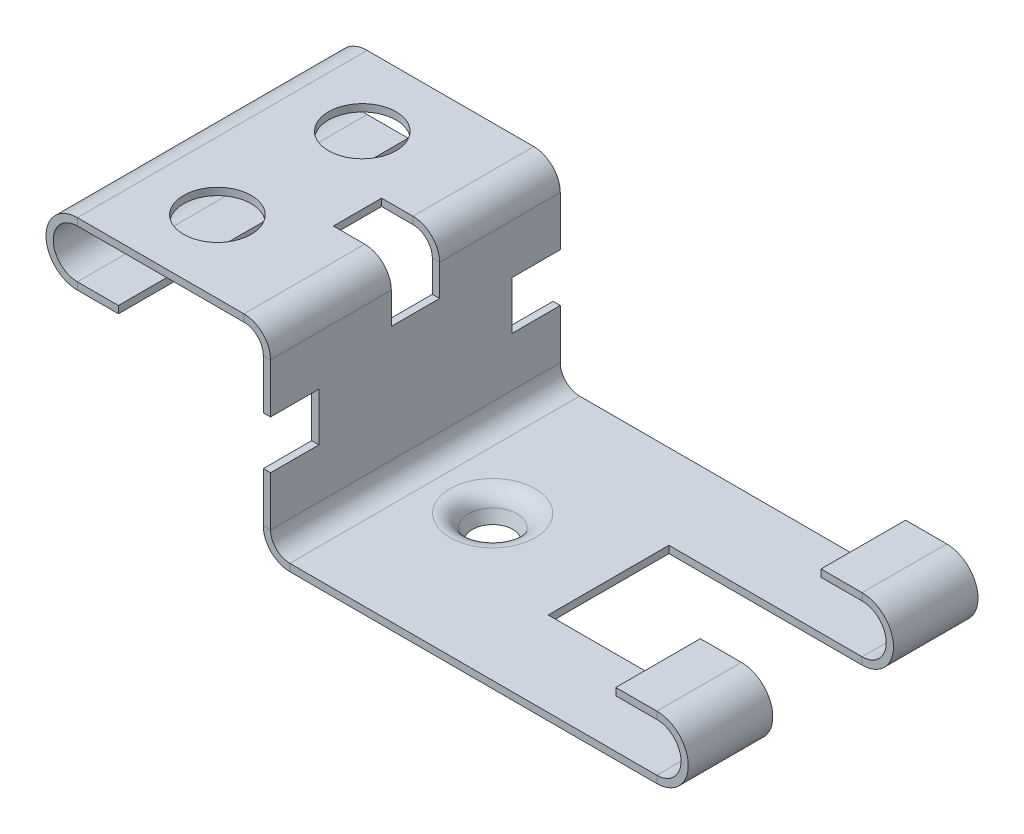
ISO-10303-21;
HEADER;
FILE_DESCRIPTION(('STEP AP214'),'2;1');
FILE_NAME('part.step','',(''),(''),'','','');
FILE_SCHEMA(('AUTOMOTIVE_DESIGN { 1 0 10303 214 1 1 1 1 }'));
ENDSEC;
DATA;
#1=APPLICATION_CONTEXT('core data for automotive mechanical design processes');
#2=APPLICATION_PROTOCOL_DEFINITION('international standard','automotive_design',2000,#1);
#3=PRODUCT_CONTEXT('',#1,'mechanical');
#4=PRODUCT('Part','Part','',(#3));
#5=PRODUCT_RELATED_PRODUCT_CATEGORY('part','',(#4));
#6=PRODUCT_DEFINITION_FORMATION('','',#4);
#7=PRODUCT_DEFINITION_CONTEXT('part definition',#1,'design');
#8=PRODUCT_DEFINITION('design','',#6,#7);
#9=PRODUCT_DEFINITION_SHAPE('','',#8);
#10=(LENGTH_UNIT() NAMED_UNIT(*) SI_UNIT(.MILLI.,.METRE.));
#11=(NAMED_UNIT(*) PLANE_ANGLE_UNIT() SI_UNIT($,.RADIAN.));
#12=(NAMED_UNIT(*) SI_UNIT($,.STERADIAN.) SOLID_ANGLE_UNIT());
#13=UNCERTAINTY_MEASURE_WITH_UNIT(LENGTH_MEASURE(1.E-05),#10,'distance_accuracy_value','');
#14=(GEOMETRIC_REPRESENTATION_CONTEXT(3) GLOBAL_UNCERTAINTY_ASSIGNED_CONTEXT((#13)) GLOBAL_UNIT_ASSIGNED_CONTEXT((#10,
#11,#12)) REPRESENTATION_CONTEXT('',''));
#15=CARTESIAN_POINT('',(0.,0.,0.));
#16=DIRECTION('',(0.,0.,1.));
#17=DIRECTION('',(1.,0.,0.));
#18=AXIS2_PLACEMENT_3D('',#15,#16,#17);
#19=CARTESIAN_POINT('',(0.,-1.5,0.));
#20=DIRECTION('',(0.,1.,0.));
#21=DIRECTION('',(0.,0.,1.));
#22=AXIS2_PLACEMENT_3D('',#19,#20,#21);
#23=PLANE('',#22);
#24=DIRECTION('',(1.,0.,0.));
#25=VECTOR('',#24,1.);
#26=CARTESIAN_POINT('',(0.,-1.5,-12.5));
#27=LINE('',#26,#25);
#28=CARTESIAN_POINT('',(0.,-1.5,-12.5));
#29=VERTEX_POINT('',#28);
#30=CARTESIAN_POINT('',(40.,-1.5,-12.5));
#31=VERTEX_POINT('',#30);
#32=EDGE_CURVE('E550',#29,#31,#27,.T.);
#33=ORIENTED_EDGE('',*,*,#32,.F.);
#34=DIRECTION('',(0.,0.,-1.));
#35=VECTOR('',#34,1.);
#36=CARTESIAN_POINT('',(0.,-1.5,0.));
#37=LINE('',#36,#35);
#38=CARTESIAN_POINT('',(0.,-1.5,12.5));
#39=VERTEX_POINT('',#38);
#40=EDGE_CURVE('E553',#39,#29,#37,.T.);
#41=ORIENTED_EDGE('',*,*,#40,.F.);
#42=DIRECTION('',(-1.,0.,0.));
#43=VECTOR('',#42,1.);
#44=CARTESIAN_POINT('',(0.,-1.5,12.5));
#45=LINE('',#44,#43);
#46=CARTESIAN_POINT('',(40.,-1.5,12.5));
#47=VERTEX_POINT('',#46);
#48=EDGE_CURVE('E533',#47,#39,#45,.T.);
#49=ORIENTED_EDGE('',*,*,#48,.F.);
#50=DIRECTION('',(0.,0.,-1.));
#51=VECTOR('',#50,1.);
#52=CARTESIAN_POINT('',(40.,-1.5,-30.));
#53=LINE('',#52,#51);
#54=CARTESIAN_POINT('',(40.,-1.5,30.));
#55=VERTEX_POINT('',#54);
#56=EDGE_CURVE('E656',#55,#47,#53,.T.);
#57=ORIENTED_EDGE('',*,*,#56,.F.);
#58=DIRECTION('',(1.,0.,0.));
#59=VECTOR('',#58,1.);
#60=CARTESIAN_POINT('',(-40.,-1.5,30.));
#61=LINE('',#60,#59);
#62=CARTESIAN_POINT('',(-36.,-1.50000000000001,30.));
#63=VERTEX_POINT('',#62);
#64=EDGE_CURVE('E663',#63,#55,#61,.T.);
#65=ORIENTED_EDGE('',*,*,#64,.F.);
#66=DIRECTION('',(0.,0.,1.));
#67=VECTOR('',#66,1.);
#68=CARTESIAN_POINT('',(-36.,-1.50000000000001,30.));
#69=LINE('',#68,#67);
#70=CARTESIAN_POINT('',(-36.,-1.5,-30.));
#71=VERTEX_POINT('',#70);
#72=EDGE_CURVE('E633',#63,#71,#69,.F.);
#73=ORIENTED_EDGE('',*,*,#72,.T.);
#74=DIRECTION('',(-1.,0.,0.));
#75=VECTOR('',#74,1.);
#76=CARTESIAN_POINT('',(-40.,-1.5,-30.));
#77=LINE('',#76,#75);
#78=CARTESIAN_POINT('',(40.,-1.5,-30.));
#79=VERTEX_POINT('',#78);
#80=EDGE_CURVE('E659',#79,#71,#77,.T.);
#81=ORIENTED_EDGE('',*,*,#80,.F.);
#82=EDGE_CURVE('E660',#31,#79,#53,.T.);
#83=ORIENTED_EDGE('',*,*,#82,.F.);
#84=EDGE_LOOP('',(#33,#41,#49,#57,#65,#73,#81,#83));
#85=FACE_BOUND('',#84,.T.);
#86=CARTESIAN_POINT('',(-24.,-1.5,0.));
#87=DIRECTION('',(0.,-1.,0.));
#88=DIRECTION('',(0.,0.,-1.));
#89=AXIS2_PLACEMENT_3D('',#86,#87,#88);
#90=CIRCLE('',#89,8.80083015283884);
#91=CARTESIAN_POINT('',(-24.,-1.5,-8.80083015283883));
#92=VERTEX_POINT('',#91);
#93=EDGE_CURVE('E13',#92,#92,#90,.T.);
#94=ORIENTED_EDGE('',*,*,#93,.F.);
#95=EDGE_LOOP('',(#94));
#96=FACE_BOUND('',#95,.T.);
#97=ADVANCED_FACE('F59',(#85,#96),#23,.F.);
#98=CARTESIAN_POINT('',(0.,0.,0.));
#99=DIRECTION('',(0.,1.,0.));
#100=DIRECTION('',(0.,0.,1.));
#101=AXIS2_PLACEMENT_3D('',#98,#99,#100);
#102=PLANE('',#101);
#103=DIRECTION('',(0.,0.,-1.));
#104=VECTOR('',#103,1.);
#105=CARTESIAN_POINT('',(0.,0.,0.));
#106=LINE('',#105,#104);
#107=CARTESIAN_POINT('',(0.,0.,12.5));
#108=VERTEX_POINT('',#107);
#109=CARTESIAN_POINT('',(0.,0.,-12.5));
#110=VERTEX_POINT('',#109);
#111=EDGE_CURVE('E685',#108,#110,#106,.T.);
#112=ORIENTED_EDGE('',*,*,#111,.T.);
#113=DIRECTION('',(1.,0.,0.));
#114=VECTOR('',#113,1.);
#115=CARTESIAN_POINT('',(0.,0.,-12.5));
#116=LINE('',#115,#114);
#117=CARTESIAN_POINT('',(40.,0.,-12.5));
#118=VERTEX_POINT('',#117);
#119=EDGE_CURVE('E541',#110,#118,#116,.T.);
#120=ORIENTED_EDGE('',*,*,#119,.T.);
#121=DIRECTION('',(0.,0.,-1.));
#122=VECTOR('',#121,1.);
#123=CARTESIAN_POINT('',(40.,0.,-30.));
#124=LINE('',#123,#122);
#125=CARTESIAN_POINT('',(40.,0.,-30.));
#126=VERTEX_POINT('',#125);
#127=EDGE_CURVE('E653',#118,#126,#124,.T.);
#128=ORIENTED_EDGE('',*,*,#127,.T.);
#129=DIRECTION('',(-1.,0.,0.));
#130=VECTOR('',#129,1.);
#131=CARTESIAN_POINT('',(-40.,0.,-30.));
#132=LINE('',#131,#130);
#133=CARTESIAN_POINT('',(-36.,0.,-30.));
#134=VERTEX_POINT('',#133);
#135=EDGE_CURVE('E669',#126,#134,#132,.T.);
#136=ORIENTED_EDGE('',*,*,#135,.T.);
#137=DIRECTION('',(0.,0.,1.));
#138=VECTOR('',#137,1.);
#139=CARTESIAN_POINT('',(-36.,0.,30.));
#140=LINE('',#139,#138);
#141=CARTESIAN_POINT('',(-36.,0.,30.));
#142=VERTEX_POINT('',#141);
#143=EDGE_CURVE('E645',#142,#134,#140,.F.);
#144=ORIENTED_EDGE('',*,*,#143,.F.);
#145=DIRECTION('',(1.,0.,0.));
#146=VECTOR('',#145,1.);
#147=CARTESIAN_POINT('',(-40.,0.,30.));
#148=LINE('',#147,#146);
#149=CARTESIAN_POINT('',(40.,0.,30.));
#150=VERTEX_POINT('',#149);
#151=EDGE_CURVE('E672',#142,#150,#148,.T.);
#152=ORIENTED_EDGE('',*,*,#151,.T.);
#153=CARTESIAN_POINT('',(40.,0.,12.5));
#154=VERTEX_POINT('',#153);
#155=EDGE_CURVE('E666',#150,#154,#124,.T.);
#156=ORIENTED_EDGE('',*,*,#155,.T.);
#157=DIRECTION('',(-1.,0.,0.));
#158=VECTOR('',#157,1.);
#159=CARTESIAN_POINT('',(0.,0.,12.5));
#160=LINE('',#159,#158);
#161=EDGE_CURVE('E524',#154,#108,#160,.T.);
#162=ORIENTED_EDGE('',*,*,#161,.T.);
#163=EDGE_LOOP('',(#112,#120,#128,#136,#144,#152,#156,#162));
#164=FACE_BOUND('',#163,.T.);
#165=CARTESIAN_POINT('',(-24.,5.6843418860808E-11,0.));
#166=DIRECTION('',(0.,-1.,0.));
#167=DIRECTION('',(0.,0.,1.));
#168=AXIS2_PLACEMENT_3D('',#165,#166,#167);
#169=CIRCLE('',#168,8.80083015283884);
#170=CARTESIAN_POINT('',(-24.,5.6843418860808E-11,8.80083015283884));
#171=VERTEX_POINT('',#170);
#172=EDGE_CURVE('E424',#171,#171,#169,.F.);
#173=ORIENTED_EDGE('',*,*,#172,.F.);
#174=EDGE_LOOP('',(#173));
#175=FACE_BOUND('',#174,.T.);
#176=ADVANCED_FACE('F867',(#164,#175),#102,.T.);
#177=CARTESIAN_POINT('',(-41.5,0.,-30.));
#178=DIRECTION('',(0.,0.,1.));
#179=DIRECTION('',(1.,0.,0.));
#180=AXIS2_PLACEMENT_3D('',#177,#178,#179);
#181=PLANE('',#180);
#182=DIRECTION('',(0.,-1.,0.));
#183=VECTOR('',#182,1.);
#184=CARTESIAN_POINT('',(-40.,0.,-30.));
#185=LINE('',#184,#183);
#186=CARTESIAN_POINT('',(-40.0000000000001,34.5,-30.));
#187=VERTEX_POINT('',#186);
#188=CARTESIAN_POINT('',(-40.0000000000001,24.2499999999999,-30.));
#189=VERTEX_POINT('',#188);
#190=EDGE_CURVE('E627',#187,#189,#185,.T.);
#191=ORIENTED_EDGE('',*,*,#190,.T.);
#192=DIRECTION('',(1.,0.,0.));
#193=VECTOR('',#192,1.);
#194=CARTESIAN_POINT('',(-41.5000000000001,24.2499999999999,-30.));
#195=LINE('',#194,#193);
#196=CARTESIAN_POINT('',(-41.5000000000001,24.2499999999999,-30.));
#197=VERTEX_POINT('',#196);
#198=EDGE_CURVE('E482',#197,#189,#195,.T.);
#199=ORIENTED_EDGE('',*,*,#198,.F.);
#200=DIRECTION('',(0.,-1.,0.));
#201=VECTOR('',#200,1.);
#202=CARTESIAN_POINT('',(-41.5,0.,-30.));
#203=LINE('',#202,#201);
#204=CARTESIAN_POINT('',(-41.5000000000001,34.5,-30.));
#205=VERTEX_POINT('',#204);
#206=EDGE_CURVE('E618',#205,#197,#203,.T.);
#207=ORIENTED_EDGE('',*,*,#206,.F.);
#208=DIRECTION('',(1.,0.,0.));
#209=VECTOR('',#208,1.);
#210=CARTESIAN_POINT('',(-41.5000000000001,34.5,-30.));
#211=LINE('',#210,#209);
#212=EDGE_CURVE('E704',#205,#187,#211,.T.);
#213=ORIENTED_EDGE('',*,*,#212,.T.);
#214=EDGE_LOOP('',(#191,#199,#207,#213));
#215=FACE_BOUND('',#214,.T.);
#216=ADVANCED_FACE('F969',(#215),#181,.F.);
#217=CARTESIAN_POINT('',(-41.5000000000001,40.,30.));
#218=DIRECTION('',(0.,0.,-1.));
#219=DIRECTION('',(-1.,0.,0.));
#220=AXIS2_PLACEMENT_3D('',#217,#218,#219);
#221=PLANE('',#220);
#222=DIRECTION('',(0.,1.,0.));
#223=VECTOR('',#222,1.);
#224=CARTESIAN_POINT('',(-41.5000000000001,40.,30.));
#225=LINE('',#224,#223);
#226=CARTESIAN_POINT('',(-41.5000000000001,24.2499999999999,30.));
#227=VERTEX_POINT('',#226);
#228=CARTESIAN_POINT('',(-41.5000000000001,34.5,30.));
#229=VERTEX_POINT('',#228);
#230=EDGE_CURVE('E621',#227,#229,#225,.T.);
#231=ORIENTED_EDGE('',*,*,#230,.F.);
#232=DIRECTION('',(1.,0.,0.));
#233=VECTOR('',#232,1.);
#234=CARTESIAN_POINT('',(-41.5000000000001,24.2499999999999,30.));
#235=LINE('',#234,#233);
#236=CARTESIAN_POINT('',(-40.0000000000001,24.2499999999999,30.));
#237=VERTEX_POINT('',#236);
#238=EDGE_CURVE('E506',#227,#237,#235,.T.);
#239=ORIENTED_EDGE('',*,*,#238,.T.);
#240=DIRECTION('',(0.,1.,0.));
#241=VECTOR('',#240,1.);
#242=CARTESIAN_POINT('',(-40.0000000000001,40.,30.));
#243=LINE('',#242,#241);
#244=CARTESIAN_POINT('',(-40.0000000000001,34.5,30.));
#245=VERTEX_POINT('',#244);
#246=EDGE_CURVE('E82',#237,#245,#243,.T.);
#247=ORIENTED_EDGE('',*,*,#246,.T.);
#248=DIRECTION('',(1.,0.,0.));
#249=VECTOR('',#248,1.);
#250=CARTESIAN_POINT('',(-41.5000000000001,34.5,30.));
#251=LINE('',#250,#249);
#252=EDGE_CURVE('E710',#229,#245,#251,.T.);
#253=ORIENTED_EDGE('',*,*,#252,.F.);
#254=EDGE_LOOP('',(#231,#239,#247,#253));
#255=FACE_BOUND('',#254,.T.);
#256=ADVANCED_FACE('F827',(#255),#221,.F.);
#257=CARTESIAN_POINT('',(0.,46.,12.5));
#258=DIRECTION('',(0.,0.,-1.));
#259=DIRECTION('',(-1.,0.,0.));
#260=AXIS2_PLACEMENT_3D('',#257,#258,#259);
#261=PLANE('',#260);
#262=DIRECTION('',(-1.,0.,0.));
#263=VECTOR('',#262,1.);
#264=CARTESIAN_POINT('',(35.75,11.5,12.5));
#265=LINE('',#264,#263);
#266=CARTESIAN_POINT('',(40.,11.5,12.5));
#267=VERTEX_POINT('',#266);
#268=CARTESIAN_POINT('',(31.5,11.5,12.5));
#269=VERTEX_POINT('',#268);
#270=EDGE_CURVE('E527',#267,#269,#265,.T.);
#271=ORIENTED_EDGE('',*,*,#270,.F.);
#272=DIRECTION('',(0.,-1.,0.));
#273=VECTOR('',#272,1.);
#274=CARTESIAN_POINT('',(40.,11.5,12.5));
#275=LINE('',#274,#273);
#276=CARTESIAN_POINT('',(40.,10.,12.5));
#277=VERTEX_POINT('',#276);
#278=EDGE_CURVE('E694',#267,#277,#275,.T.);
#279=ORIENTED_EDGE('',*,*,#278,.T.);
#280=DIRECTION('',(-1.,0.,0.));
#281=VECTOR('',#280,1.);
#282=CARTESIAN_POINT('',(35.75,10.,12.5));
#283=LINE('',#282,#281);
#284=CARTESIAN_POINT('',(31.5,10.,12.5));
#285=VERTEX_POINT('',#284);
#286=EDGE_CURVE('E519',#277,#285,#283,.T.);
#287=ORIENTED_EDGE('',*,*,#286,.T.);
#288=DIRECTION('',(0.,1.,0.));
#289=VECTOR('',#288,1.);
#290=CARTESIAN_POINT('',(31.5,11.5,12.5));
#291=LINE('',#290,#289);
#292=EDGE_CURVE('E521',#269,#285,#291,.F.);
#293=ORIENTED_EDGE('',*,*,#292,.F.);
#294=EDGE_LOOP('',(#271,#279,#287,#293));
#295=FACE_BOUND('',#294,.T.);
#296=ADVANCED_FACE('F897',(#295),#261,.T.);
#297=ORIENTED_EDGE('',*,*,#161,.F.);
#298=DIRECTION('',(0.,-1.,0.));
#299=VECTOR('',#298,1.);
#300=CARTESIAN_POINT('',(40.,0.,12.5));
#301=LINE('',#300,#299);
#302=EDGE_CURVE('E692',#154,#47,#301,.T.);
#303=ORIENTED_EDGE('',*,*,#302,.T.);
#304=ORIENTED_EDGE('',*,*,#48,.T.);
#305=DIRECTION('',(0.,-1.,0.));
#306=VECTOR('',#305,1.);
#307=CARTESIAN_POINT('',(0.,46.,12.5));
#308=LINE('',#307,#306);
#309=EDGE_CURVE('E508',#108,#39,#308,.T.);
#310=ORIENTED_EDGE('',*,*,#309,.F.);
#311=EDGE_LOOP('',(#297,#303,#304,#310));
#312=FACE_BOUND('',#311,.T.);
#313=ADVANCED_FACE('F914',(#312),#261,.T.);
#314=CARTESIAN_POINT('',(0.,46.,-12.5));
#315=DIRECTION('',(0.,0.,1.));
#316=DIRECTION('',(1.,0.,0.));
#317=AXIS2_PLACEMENT_3D('',#314,#315,#316);
#318=PLANE('',#317);
#319=DIRECTION('',(1.,0.,0.));
#320=VECTOR('',#319,1.);
#321=CARTESIAN_POINT('',(35.75,10.,-12.5));
#322=LINE('',#321,#320);
#323=CARTESIAN_POINT('',(31.5,10.,-12.5));
#324=VERTEX_POINT('',#323);
#325=CARTESIAN_POINT('',(40.,10.,-12.5));
#326=VERTEX_POINT('',#325);
#327=EDGE_CURVE('E535',#324,#326,#322,.T.);
#328=ORIENTED_EDGE('',*,*,#327,.T.);
#329=DIRECTION('',(0.,1.,0.));
#330=VECTOR('',#329,1.);
#331=CARTESIAN_POINT('',(40.,10.,-12.5));
#332=LINE('',#331,#330);
#333=CARTESIAN_POINT('',(40.,11.5,-12.5));
#334=VERTEX_POINT('',#333);
#335=EDGE_CURVE('E690',#326,#334,#332,.T.);
#336=ORIENTED_EDGE('',*,*,#335,.T.);
#337=DIRECTION('',(1.,0.,0.));
#338=VECTOR('',#337,1.);
#339=CARTESIAN_POINT('',(35.75,11.5,-12.5));
#340=LINE('',#339,#338);
#341=CARTESIAN_POINT('',(31.5,11.5,-12.5));
#342=VERTEX_POINT('',#341);
#343=EDGE_CURVE('E544',#342,#334,#340,.T.);
#344=ORIENTED_EDGE('',*,*,#343,.F.);
#345=DIRECTION('',(0.,-1.,0.));
#346=VECTOR('',#345,1.);
#347=CARTESIAN_POINT('',(31.5,11.5,-12.5));
#348=LINE('',#347,#346);
#349=EDGE_CURVE('E538',#324,#342,#348,.F.);
#350=ORIENTED_EDGE('',*,*,#349,.F.);
#351=EDGE_LOOP('',(#328,#336,#344,#350));
#352=FACE_BOUND('',#351,.T.);
#353=ADVANCED_FACE('F943',(#352),#318,.T.);
#354=ORIENTED_EDGE('',*,*,#32,.T.);
#355=DIRECTION('',(0.,1.,0.));
#356=VECTOR('',#355,1.);
#357=CARTESIAN_POINT('',(40.,-1.5,-12.5));
#358=LINE('',#357,#356);
#359=EDGE_CURVE('E688',#31,#118,#358,.T.);
#360=ORIENTED_EDGE('',*,*,#359,.T.);
#361=ORIENTED_EDGE('',*,*,#119,.F.);
#362=DIRECTION('',(0.,-1.,0.));
#363=VECTOR('',#362,1.);
#364=CARTESIAN_POINT('',(0.,46.,-12.5));
#365=LINE('',#364,#363);
#366=EDGE_CURVE('E516',#110,#29,#365,.T.);
#367=ORIENTED_EDGE('',*,*,#366,.T.);
#368=EDGE_LOOP('',(#354,#360,#361,#367));
#369=FACE_BOUND('',#368,.T.);
#370=ADVANCED_FACE('F1017',(#369),#318,.T.);
#371=CARTESIAN_POINT('',(31.5,11.5,0.));
#372=DIRECTION('',(1.,0.,0.));
#373=DIRECTION('',(0.,0.,-1.));
#374=AXIS2_PLACEMENT_3D('',#371,#372,#373);
#375=PLANE('',#374);
#376=DIRECTION('',(0.,0.,1.));
#377=VECTOR('',#376,1.);
#378=CARTESIAN_POINT('',(31.5,10.,0.));
#379=LINE('',#378,#377);
#380=CARTESIAN_POINT('',(31.5,10.,-30.));
#381=VERTEX_POINT('',#380);
#382=EDGE_CURVE('E586',#324,#381,#379,.F.);
#383=ORIENTED_EDGE('',*,*,#382,.F.);
#384=ORIENTED_EDGE('',*,*,#349,.T.);
#385=DIRECTION('',(0.,0.,-1.));
#386=VECTOR('',#385,1.);
#387=CARTESIAN_POINT('',(31.5,11.5,0.));
#388=LINE('',#387,#386);
#389=CARTESIAN_POINT('',(31.5,11.5,-30.));
#390=VERTEX_POINT('',#389);
#391=EDGE_CURVE('E572',#342,#390,#388,.T.);
#392=ORIENTED_EDGE('',*,*,#391,.T.);
#393=DIRECTION('',(0.,1.,0.));
#394=VECTOR('',#393,1.);
#395=CARTESIAN_POINT('',(31.5,11.5,-30.));
#396=LINE('',#395,#394);
#397=EDGE_CURVE('E596',#381,#390,#396,.T.);
#398=ORIENTED_EDGE('',*,*,#397,.F.);
#399=EDGE_LOOP('',(#383,#384,#392,#398));
#400=FACE_BOUND('',#399,.T.);
#401=ADVANCED_FACE('F947',(#400),#375,.F.);
#402=CARTESIAN_POINT('',(31.5,11.5,30.));
#403=VERTEX_POINT('',#402);
#404=EDGE_CURVE('E568',#403,#269,#388,.T.);
#405=ORIENTED_EDGE('',*,*,#404,.T.);
#406=ORIENTED_EDGE('',*,*,#292,.T.);
#407=CARTESIAN_POINT('',(31.5,10.,30.));
#408=VERTEX_POINT('',#407);
#409=EDGE_CURVE('E583',#408,#285,#379,.F.);
#410=ORIENTED_EDGE('',*,*,#409,.F.);
#411=DIRECTION('',(0.,1.,0.));
#412=VECTOR('',#411,1.);
#413=CARTESIAN_POINT('',(31.5,11.5,30.));
#414=LINE('',#413,#412);
#415=EDGE_CURVE('E571',#408,#403,#414,.T.);
#416=ORIENTED_EDGE('',*,*,#415,.T.);
#417=EDGE_LOOP('',(#405,#406,#410,#416));
#418=FACE_BOUND('',#417,.T.);
#419=ADVANCED_FACE('F894',(#418),#375,.F.);
#420=CARTESIAN_POINT('',(35.75,11.5,0.));
#421=DIRECTION('',(0.,1.,0.));
#422=DIRECTION('',(0.,0.,1.));
#423=AXIS2_PLACEMENT_3D('',#420,#421,#422);
#424=PLANE('',#423);
#425=ORIENTED_EDGE('',*,*,#391,.F.);
#426=ORIENTED_EDGE('',*,*,#343,.T.);
#427=DIRECTION('',(0.,0.,1.));
#428=VECTOR('',#427,1.);
#429=CARTESIAN_POINT('',(40.,11.5,0.));
#430=LINE('',#429,#428);
#431=CARTESIAN_POINT('',(40.,11.5,-30.));
#432=VERTEX_POINT('',#431);
#433=EDGE_CURVE('E576',#432,#334,#430,.T.);
#434=ORIENTED_EDGE('',*,*,#433,.F.);
#435=DIRECTION('',(1.,0.,0.));
#436=VECTOR('',#435,1.);
#437=CARTESIAN_POINT('',(35.75,11.5,-30.));
#438=LINE('',#437,#436);
#439=EDGE_CURVE('E573',#390,#432,#438,.T.);
#440=ORIENTED_EDGE('',*,*,#439,.F.);
#441=EDGE_LOOP('',(#425,#426,#434,#440));
#442=FACE_BOUND('',#441,.T.);
#443=ADVANCED_FACE('F940',(#442),#424,.T.);
#444=CARTESIAN_POINT('',(40.,11.5,30.));
#445=VERTEX_POINT('',#444);
#446=EDGE_CURVE('E579',#267,#445,#430,.T.);
#447=ORIENTED_EDGE('',*,*,#446,.F.);
#448=ORIENTED_EDGE('',*,*,#270,.T.);
#449=ORIENTED_EDGE('',*,*,#404,.F.);
#450=DIRECTION('',(-1.,0.,0.));
#451=VECTOR('',#450,1.);
#452=CARTESIAN_POINT('',(35.75,11.5,30.));
#453=LINE('',#452,#451);
#454=EDGE_CURVE('E580',#445,#403,#453,.T.);
#455=ORIENTED_EDGE('',*,*,#454,.F.);
#456=EDGE_LOOP('',(#447,#448,#449,#455));
#457=FACE_BOUND('',#456,.T.);
#458=ADVANCED_FACE('F900',(#457),#424,.T.);
#459=CARTESIAN_POINT('',(35.75,10.,0.));
#460=DIRECTION('',(0.,1.,0.));
#461=DIRECTION('',(0.,0.,1.));
#462=AXIS2_PLACEMENT_3D('',#459,#460,#461);
#463=PLANE('',#462);
#464=ORIENTED_EDGE('',*,*,#327,.F.);
#465=ORIENTED_EDGE('',*,*,#382,.T.);
#466=DIRECTION('',(1.,0.,0.));
#467=VECTOR('',#466,1.);
#468=CARTESIAN_POINT('',(35.75,10.,-30.));
#469=LINE('',#468,#467);
#470=CARTESIAN_POINT('',(40.,10.,-30.));
#471=VERTEX_POINT('',#470);
#472=EDGE_CURVE('E587',#381,#471,#469,.T.);
#473=ORIENTED_EDGE('',*,*,#472,.T.);
#474=DIRECTION('',(0.,0.,1.));
#475=VECTOR('',#474,1.);
#476=CARTESIAN_POINT('',(40.,10.,0.));
#477=LINE('',#476,#475);
#478=EDGE_CURVE('E590',#471,#326,#477,.T.);
#479=ORIENTED_EDGE('',*,*,#478,.T.);
#480=EDGE_LOOP('',(#464,#465,#473,#479));
#481=FACE_BOUND('',#480,.T.);
#482=ADVANCED_FACE('F951',(#481),#463,.F.);
#483=ORIENTED_EDGE('',*,*,#286,.F.);
#484=CARTESIAN_POINT('',(40.,10.,30.));
#485=VERTEX_POINT('',#484);
#486=EDGE_CURVE('E593',#277,#485,#477,.T.);
#487=ORIENTED_EDGE('',*,*,#486,.T.);
#488=DIRECTION('',(1.,0.,0.));
#489=VECTOR('',#488,1.);
#490=CARTESIAN_POINT('',(35.75,10.,30.));
#491=LINE('',#490,#489);
#492=EDGE_CURVE('E559',#485,#408,#491,.F.);
#493=ORIENTED_EDGE('',*,*,#492,.T.);
#494=ORIENTED_EDGE('',*,*,#409,.T.);
#495=EDGE_LOOP('',(#483,#487,#493,#494));
#496=FACE_BOUND('',#495,.T.);
#497=ADVANCED_FACE('F892',(#496),#463,.F.);
#498=CARTESIAN_POINT('',(40.,5.,-30.));
#499=DIRECTION('',(0.,0.,-1.));
#500=DIRECTION('',(0.,1.,0.));
#501=AXIS2_PLACEMENT_3D('',#498,#499,#500);
#502=CYLINDRICAL_SURFACE('',#501,6.5);
#503=ORIENTED_EDGE('',*,*,#433,.T.);
#504=CARTESIAN_POINT('',(40.,5.,-12.5));
#505=DIRECTION('',(0.,0.,1.));
#506=DIRECTION('',(1.,0.,0.));
#507=AXIS2_PLACEMENT_3D('',#504,#505,#506);
#508=CIRCLE('',#507,6.5);
#509=EDGE_CURVE('E547',#334,#31,#508,.F.);
#510=ORIENTED_EDGE('',*,*,#509,.T.);
#511=ORIENTED_EDGE('',*,*,#82,.T.);
#512=CARTESIAN_POINT('',(40.,5.,-30.));
#513=DIRECTION('',(0.,0.,-1.));
#514=DIRECTION('',(-1.,0.,0.));
#515=AXIS2_PLACEMENT_3D('',#512,#513,#514);
#516=CIRCLE('',#515,6.5);
#517=EDGE_CURVE('E560',#432,#79,#516,.T.);
#518=ORIENTED_EDGE('',*,*,#517,.F.);
#519=EDGE_LOOP('',(#503,#510,#511,#518));
#520=FACE_BOUND('',#519,.T.);
#521=ADVANCED_FACE('F934',(#520),#502,.T.);
#522=ORIENTED_EDGE('',*,*,#56,.T.);
#523=CARTESIAN_POINT('',(40.,5.,12.5));
#524=DIRECTION('',(0.,0.,-1.));
#525=DIRECTION('',(-1.,0.,0.));
#526=AXIS2_PLACEMENT_3D('',#523,#524,#525);
#527=CIRCLE('',#526,6.5);
#528=EDGE_CURVE('E530',#47,#267,#527,.F.);
#529=ORIENTED_EDGE('',*,*,#528,.T.);
#530=ORIENTED_EDGE('',*,*,#446,.T.);
#531=CARTESIAN_POINT('',(40.,5.,30.));
#532=DIRECTION('',(0.,0.,-1.));
#533=DIRECTION('',(-1.,0.,0.));
#534=AXIS2_PLACEMENT_3D('',#531,#532,#533);
#535=CIRCLE('',#534,6.5);
#536=EDGE_CURVE('E556',#55,#445,#535,.F.);
#537=ORIENTED_EDGE('',*,*,#536,.F.);
#538=EDGE_LOOP('',(#522,#529,#530,#537));
#539=FACE_BOUND('',#538,.T.);
#540=ADVANCED_FACE('F902',(#539),#502,.T.);
#541=CARTESIAN_POINT('',(40.,5.,-30.));
#542=DIRECTION('',(0.,0.,-1.));
#543=DIRECTION('',(0.,1.,0.));
#544=AXIS2_PLACEMENT_3D('',#541,#542,#543);
#545=CYLINDRICAL_SURFACE('',#544,5.);
#546=CARTESIAN_POINT('',(40.,5.,-12.5));
#547=DIRECTION('',(0.,0.,1.));
#548=DIRECTION('',(1.,0.,0.));
#549=AXIS2_PLACEMENT_3D('',#546,#547,#548);
#550=CIRCLE('',#549,5.);
#551=EDGE_CURVE('E682',#326,#118,#550,.F.);
#552=ORIENTED_EDGE('',*,*,#551,.F.);
#553=ORIENTED_EDGE('',*,*,#478,.F.);
#554=CARTESIAN_POINT('',(40.,5.,-30.));
#555=DIRECTION('',(0.,0.,-1.));
#556=DIRECTION('',(-1.,0.,0.));
#557=AXIS2_PLACEMENT_3D('',#554,#555,#556);
#558=CIRCLE('',#557,5.);
#559=EDGE_CURVE('E555',#471,#126,#558,.T.);
#560=ORIENTED_EDGE('',*,*,#559,.T.);
#561=ORIENTED_EDGE('',*,*,#127,.F.);
#562=EDGE_LOOP('',(#552,#553,#560,#561));
#563=FACE_BOUND('',#562,.T.);
#564=ADVANCED_FACE('F922',(#563),#545,.F.);
#565=CARTESIAN_POINT('',(40.,5.,12.5));
#566=DIRECTION('',(0.,0.,-1.));
#567=DIRECTION('',(-1.,0.,0.));
#568=AXIS2_PLACEMENT_3D('',#565,#566,#567);
#569=CIRCLE('',#568,5.);
#570=EDGE_CURVE('E677',#154,#277,#569,.F.);
#571=ORIENTED_EDGE('',*,*,#570,.F.);
#572=ORIENTED_EDGE('',*,*,#155,.F.);
#573=CARTESIAN_POINT('',(40.,5.,30.));
#574=DIRECTION('',(0.,0.,-1.));
#575=DIRECTION('',(-1.,0.,0.));
#576=AXIS2_PLACEMENT_3D('',#573,#574,#575);
#577=CIRCLE('',#576,5.);
#578=EDGE_CURVE('E563',#150,#485,#577,.F.);
#579=ORIENTED_EDGE('',*,*,#578,.T.);
#580=ORIENTED_EDGE('',*,*,#486,.F.);
#581=EDGE_LOOP('',(#571,#572,#579,#580));
#582=FACE_BOUND('',#581,.T.);
#583=ADVANCED_FACE('F880',(#582),#545,.F.);
#584=CARTESIAN_POINT('',(-41.5,14.2499999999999,-30.));
#585=VERTEX_POINT('',#584);
#586=CARTESIAN_POINT('',(-41.5,3.99999999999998,-30.));
#587=VERTEX_POINT('',#586);
#588=EDGE_CURVE('E622',#585,#587,#203,.T.);
#589=ORIENTED_EDGE('',*,*,#588,.F.);
#590=DIRECTION('',(1.,0.,0.));
#591=VECTOR('',#590,1.);
#592=CARTESIAN_POINT('',(-41.5,14.2499999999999,-30.));
#593=LINE('',#592,#591);
#594=CARTESIAN_POINT('',(-40.,14.2499999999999,-30.));
#595=VERTEX_POINT('',#594);
#596=EDGE_CURVE('E484',#585,#595,#593,.T.);
#597=ORIENTED_EDGE('',*,*,#596,.T.);
#598=CARTESIAN_POINT('',(-40.,3.99999999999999,-30.));
#599=VERTEX_POINT('',#598);
#600=EDGE_CURVE('E617',#595,#599,#185,.T.);
#601=ORIENTED_EDGE('',*,*,#600,.T.);
#602=DIRECTION('',(-1.,0.,0.));
#603=VECTOR('',#602,1.);
#604=CARTESIAN_POINT('',(-40.,3.99999999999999,-30.));
#605=LINE('',#604,#603);
#606=EDGE_CURVE('E605',#599,#587,#605,.T.);
#607=ORIENTED_EDGE('',*,*,#606,.T.);
#608=EDGE_LOOP('',(#589,#597,#601,#607));
#609=FACE_BOUND('',#608,.T.);
#610=ADVANCED_FACE('F859',(#609),#181,.F.);
#611=CARTESIAN_POINT('',(-40.,3.99999999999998,30.));
#612=VERTEX_POINT('',#611);
#613=CARTESIAN_POINT('',(-40.,14.2499999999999,30.));
#614=VERTEX_POINT('',#613);
#615=EDGE_CURVE('E630',#612,#614,#243,.T.);
#616=ORIENTED_EDGE('',*,*,#615,.T.);
#617=DIRECTION('',(1.,0.,0.));
#618=VECTOR('',#617,1.);
#619=CARTESIAN_POINT('',(-41.5,14.2499999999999,30.));
#620=LINE('',#619,#618);
#621=CARTESIAN_POINT('',(-41.5,14.2499999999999,30.));
#622=VERTEX_POINT('',#621);
#623=EDGE_CURVE('E499',#622,#614,#620,.T.);
#624=ORIENTED_EDGE('',*,*,#623,.F.);
#625=CARTESIAN_POINT('',(-41.5,3.99999999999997,30.));
#626=VERTEX_POINT('',#625);
#627=EDGE_CURVE('E623',#626,#622,#225,.T.);
#628=ORIENTED_EDGE('',*,*,#627,.F.);
#629=DIRECTION('',(-1.,0.,0.));
#630=VECTOR('',#629,1.);
#631=CARTESIAN_POINT('',(-40.,3.99999999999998,30.));
#632=LINE('',#631,#630);
#633=EDGE_CURVE('E609',#612,#626,#632,.T.);
#634=ORIENTED_EDGE('',*,*,#633,.F.);
#635=EDGE_LOOP('',(#616,#624,#628,#634));
#636=FACE_BOUND('',#635,.T.);
#637=ADVANCED_FACE('F842',(#636),#221,.F.);
#638=CARTESIAN_POINT('',(-41.5,-1.50953993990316E-13,0.));
#639=DIRECTION('',(1.,0.,0.));
#640=DIRECTION('',(0.,1.,0.));
#641=AXIS2_PLACEMENT_3D('',#638,#639,#640);
#642=PLANE('',#641);
#643=DIRECTION('',(0.,0.,-1.));
#644=VECTOR('',#643,1.);
#645=CARTESIAN_POINT('',(-41.5000000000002,28.,5.00000000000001));
#646=LINE('',#645,#644);
#647=CARTESIAN_POINT('',(-41.5000000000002,28.,5.00000000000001));
#648=VERTEX_POINT('',#647);
#649=CARTESIAN_POINT('',(-41.5000000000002,28.,-4.99999999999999));
#650=VERTEX_POINT('',#649);
#651=EDGE_CURVE('E449',#648,#650,#646,.T.);
#652=ORIENTED_EDGE('',*,*,#651,.T.);
#653=DIRECTION('',(0.,1.,0.));
#654=VECTOR('',#653,1.);
#655=CARTESIAN_POINT('',(-41.5000000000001,48.4612825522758,-4.99999999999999));
#656=LINE('',#655,#654);
#657=CARTESIAN_POINT('',(-41.5000000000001,34.5,-4.99999999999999));
#658=VERTEX_POINT('',#657);
#659=EDGE_CURVE('E457',#650,#658,#656,.T.);
#660=ORIENTED_EDGE('',*,*,#659,.T.);
#661=DIRECTION('',(0.,0.,1.));
#662=VECTOR('',#661,1.);
#663=CARTESIAN_POINT('',(-41.5000000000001,34.5,-30.));
#664=LINE('',#663,#662);
#665=EDGE_CURVE('E696',#205,#658,#664,.T.);
#666=ORIENTED_EDGE('',*,*,#665,.F.);
#667=ORIENTED_EDGE('',*,*,#206,.T.);
#668=DIRECTION('',(0.,0.,1.));
#669=VECTOR('',#668,1.);
#670=CARTESIAN_POINT('',(-41.5000000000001,24.2499999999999,-20.));
#671=LINE('',#670,#669);
#672=CARTESIAN_POINT('',(-41.5000000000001,24.2499999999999,-20.));
#673=VERTEX_POINT('',#672);
#674=EDGE_CURVE('E470',#197,#673,#671,.T.);
#675=ORIENTED_EDGE('',*,*,#674,.T.);
#676=DIRECTION('',(0.,-1.,0.));
#677=VECTOR('',#676,1.);
#678=CARTESIAN_POINT('',(-41.5000000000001,24.2499999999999,-20.));
#679=LINE('',#678,#677);
#680=CARTESIAN_POINT('',(-41.5,14.2499999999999,-20.));
#681=VERTEX_POINT('',#680);
#682=EDGE_CURVE('E463',#673,#681,#679,.T.);
#683=ORIENTED_EDGE('',*,*,#682,.T.);
#684=DIRECTION('',(0.,0.,-1.));
#685=VECTOR('',#684,1.);
#686=CARTESIAN_POINT('',(-41.5,14.2499999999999,-20.));
#687=LINE('',#686,#685);
#688=EDGE_CURVE('E466',#681,#585,#687,.T.);
#689=ORIENTED_EDGE('',*,*,#688,.T.);
#690=ORIENTED_EDGE('',*,*,#588,.T.);
#691=DIRECTION('',(0.,0.,-1.));
#692=VECTOR('',#691,1.);
#693=CARTESIAN_POINT('',(-41.5,3.99999999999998,0.));
#694=LINE('',#693,#692);
#695=EDGE_CURVE('E612',#626,#587,#694,.T.);
#696=ORIENTED_EDGE('',*,*,#695,.F.);
#697=ORIENTED_EDGE('',*,*,#627,.T.);
#698=DIRECTION('',(0.,0.,-1.));
#699=VECTOR('',#698,1.);
#700=CARTESIAN_POINT('',(-41.5,14.2499999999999,20.));
#701=LINE('',#700,#699);
#702=CARTESIAN_POINT('',(-41.5,14.2499999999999,20.));
#703=VERTEX_POINT('',#702);
#704=EDGE_CURVE('E489',#622,#703,#701,.T.);
#705=ORIENTED_EDGE('',*,*,#704,.T.);
#706=DIRECTION('',(0.,1.,0.));
#707=VECTOR('',#706,1.);
#708=CARTESIAN_POINT('',(-41.5000000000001,24.2499999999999,20.));
#709=LINE('',#708,#707);
#710=CARTESIAN_POINT('',(-41.5000000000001,24.2499999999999,20.));
#711=VERTEX_POINT('',#710);
#712=EDGE_CURVE('E492',#703,#711,#709,.T.);
#713=ORIENTED_EDGE('',*,*,#712,.T.);
#714=DIRECTION('',(0.,0.,1.));
#715=VECTOR('',#714,1.);
#716=CARTESIAN_POINT('',(-41.5000000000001,24.2499999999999,20.));
#717=LINE('',#716,#715);
#718=EDGE_CURVE('E496',#711,#227,#717,.T.);
#719=ORIENTED_EDGE('',*,*,#718,.T.);
#720=ORIENTED_EDGE('',*,*,#230,.T.);
#721=DIRECTION('',(0.,0.,1.));
#722=VECTOR('',#721,1.);
#723=CARTESIAN_POINT('',(-41.5000000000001,34.5,-30.));
#724=LINE('',#723,#722);
#725=CARTESIAN_POINT('',(-41.5000000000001,34.5,5.00000000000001));
#726=VERTEX_POINT('',#725);
#727=EDGE_CURVE('E707',#726,#229,#724,.T.);
#728=ORIENTED_EDGE('',*,*,#727,.F.);
#729=DIRECTION('',(0.,-1.,0.));
#730=VECTOR('',#729,1.);
#731=CARTESIAN_POINT('',(-41.5000000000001,48.4612825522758,5.00000000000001));
#732=LINE('',#731,#730);
#733=EDGE_CURVE('E453',#726,#648,#732,.T.);
#734=ORIENTED_EDGE('',*,*,#733,.T.);
#735=EDGE_LOOP('',(#652,#660,#666,#667,#675,#683,#689,#690,#696,#697,#705,#713,#719,#720,#728,#734));
#736=FACE_BOUND('',#735,.T.);
#737=ADVANCED_FACE('F726',(#736),#642,.F.);
#738=CARTESIAN_POINT('',(-40.,-1.45716771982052E-13,0.));
#739=DIRECTION('',(1.,0.,0.));
#740=DIRECTION('',(0.,1.,0.));
#741=AXIS2_PLACEMENT_3D('',#738,#739,#740);
#742=PLANE('',#741);
#743=DIRECTION('',(0.,1.,0.));
#744=VECTOR('',#743,1.);
#745=CARTESIAN_POINT('',(-40.0000000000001,48.4612825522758,-4.99999999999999));
#746=LINE('',#745,#744);
#747=CARTESIAN_POINT('',(-40.0000000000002,28.,-4.99999999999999));
#748=VERTEX_POINT('',#747);
#749=CARTESIAN_POINT('',(-40.0000000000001,34.5,-4.99999999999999));
#750=VERTEX_POINT('',#749);
#751=EDGE_CURVE('E444',#748,#750,#746,.T.);
#752=ORIENTED_EDGE('',*,*,#751,.F.);
#753=DIRECTION('',(0.,0.,-1.));
#754=VECTOR('',#753,1.);
#755=CARTESIAN_POINT('',(-40.0000000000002,28.,5.00000000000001));
#756=LINE('',#755,#754);
#757=CARTESIAN_POINT('',(-40.0000000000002,28.,5.00000000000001));
#758=VERTEX_POINT('',#757);
#759=EDGE_CURVE('E454',#758,#748,#756,.T.);
#760=ORIENTED_EDGE('',*,*,#759,.F.);
#761=DIRECTION('',(0.,-1.,0.));
#762=VECTOR('',#761,1.);
#763=CARTESIAN_POINT('',(-40.0000000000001,48.4612825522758,5.00000000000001));
#764=LINE('',#763,#762);
#765=CARTESIAN_POINT('',(-40.0000000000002,34.5,5.00000000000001));
#766=VERTEX_POINT('',#765);
#767=EDGE_CURVE('E74',#766,#758,#764,.T.);
#768=ORIENTED_EDGE('',*,*,#767,.F.);
#769=DIRECTION('',(0.,0.,1.));
#770=VECTOR('',#769,1.);
#771=CARTESIAN_POINT('',(-40.0000000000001,34.5,-30.));
#772=LINE('',#771,#770);
#773=EDGE_CURVE('E713',#766,#245,#772,.T.);
#774=ORIENTED_EDGE('',*,*,#773,.T.);
#775=ORIENTED_EDGE('',*,*,#246,.F.);
#776=DIRECTION('',(0.,0.,1.));
#777=VECTOR('',#776,1.);
#778=CARTESIAN_POINT('',(-40.0000000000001,24.2499999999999,20.));
#779=LINE('',#778,#777);
#780=CARTESIAN_POINT('',(-40.0000000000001,24.2499999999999,20.));
#781=VERTEX_POINT('',#780);
#782=EDGE_CURVE('E493',#781,#237,#779,.T.);
#783=ORIENTED_EDGE('',*,*,#782,.F.);
#784=DIRECTION('',(0.,1.,0.));
#785=VECTOR('',#784,1.);
#786=CARTESIAN_POINT('',(-40.0000000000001,24.2499999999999,20.));
#787=LINE('',#786,#785);
#788=CARTESIAN_POINT('',(-40.,14.2499999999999,20.));
#789=VERTEX_POINT('',#788);
#790=EDGE_CURVE('E502',#789,#781,#787,.T.);
#791=ORIENTED_EDGE('',*,*,#790,.F.);
#792=DIRECTION('',(0.,0.,-1.));
#793=VECTOR('',#792,1.);
#794=CARTESIAN_POINT('',(-40.,14.2499999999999,20.));
#795=LINE('',#794,#793);
#796=EDGE_CURVE('E481',#614,#789,#795,.T.);
#797=ORIENTED_EDGE('',*,*,#796,.F.);
#798=ORIENTED_EDGE('',*,*,#615,.F.);
#799=DIRECTION('',(0.,0.,1.));
#800=VECTOR('',#799,1.);
#801=CARTESIAN_POINT('',(-40.,3.99999999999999,-30.));
#802=LINE('',#801,#800);
#803=EDGE_CURVE('E607',#599,#612,#802,.T.);
#804=ORIENTED_EDGE('',*,*,#803,.F.);
#805=ORIENTED_EDGE('',*,*,#600,.F.);
#806=DIRECTION('',(0.,0.,-1.));
#807=VECTOR('',#806,1.);
#808=CARTESIAN_POINT('',(-40.,14.2499999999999,-20.));
#809=LINE('',#808,#807);
#810=CARTESIAN_POINT('',(-40.,14.2499999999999,-20.));
#811=VERTEX_POINT('',#810);
#812=EDGE_CURVE('E475',#811,#595,#809,.T.);
#813=ORIENTED_EDGE('',*,*,#812,.F.);
#814=DIRECTION('',(0.,-1.,0.));
#815=VECTOR('',#814,1.);
#816=CARTESIAN_POINT('',(-40.0000000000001,24.2499999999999,-20.));
#817=LINE('',#816,#815);
#818=CARTESIAN_POINT('',(-40.0000000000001,24.2499999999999,-20.));
#819=VERTEX_POINT('',#818);
#820=EDGE_CURVE('E460',#819,#811,#817,.T.);
#821=ORIENTED_EDGE('',*,*,#820,.F.);
#822=DIRECTION('',(0.,0.,1.));
#823=VECTOR('',#822,1.);
#824=CARTESIAN_POINT('',(-40.0000000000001,24.2499999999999,-20.));
#825=LINE('',#824,#823);
#826=EDGE_CURVE('E467',#189,#819,#825,.T.);
#827=ORIENTED_EDGE('',*,*,#826,.F.);
#828=ORIENTED_EDGE('',*,*,#190,.F.);
#829=DIRECTION('',(0.,0.,1.));
#830=VECTOR('',#829,1.);
#831=CARTESIAN_POINT('',(-40.0000000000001,34.5,-30.));
#832=LINE('',#831,#830);
#833=EDGE_CURVE('E701',#187,#750,#832,.T.);
#834=ORIENTED_EDGE('',*,*,#833,.T.);
#835=EDGE_LOOP('',(#752,#760,#768,#774,#775,#783,#791,#797,#798,#804,#805,#813,#821,#827,#828,#834));
#836=FACE_BOUND('',#835,.T.);
#837=ADVANCED_FACE('F825',(#836),#742,.T.);
#838=CARTESIAN_POINT('',(-40.,-1.5,30.));
#839=DIRECTION('',(0.,0.,1.));
#840=DIRECTION('',(1.,0.,0.));
#841=AXIS2_PLACEMENT_3D('',#838,#839,#840);
#842=PLANE('',#841);
#843=ORIENTED_EDGE('',*,*,#151,.F.);
#844=DIRECTION('',(0.,-1.,0.));
#845=VECTOR('',#844,1.);
#846=CARTESIAN_POINT('',(-36.,0.,30.));
#847=LINE('',#846,#845);
#848=EDGE_CURVE('E639',#142,#63,#847,.T.);
#849=ORIENTED_EDGE('',*,*,#848,.T.);
#850=ORIENTED_EDGE('',*,*,#64,.T.);
#851=DIRECTION('',(0.,1.,0.));
#852=VECTOR('',#851,1.);
#853=CARTESIAN_POINT('',(40.,-1.5,30.));
#854=LINE('',#853,#852);
#855=EDGE_CURVE('E674',#55,#150,#854,.T.);
#856=ORIENTED_EDGE('',*,*,#855,.T.);
#857=EDGE_LOOP('',(#843,#849,#850,#856));
#858=FACE_BOUND('',#857,.T.);
#859=ADVANCED_FACE('F871',(#858),#842,.T.);
#860=CARTESIAN_POINT('',(-40.,-1.5,-30.));
#861=DIRECTION('',(0.,0.,-1.));
#862=DIRECTION('',(-1.,0.,0.));
#863=AXIS2_PLACEMENT_3D('',#860,#861,#862);
#864=PLANE('',#863);
#865=DIRECTION('',(0.,-1.,0.));
#866=VECTOR('',#865,1.);
#867=CARTESIAN_POINT('',(-36.,0.,-30.));
#868=LINE('',#867,#866);
#869=EDGE_CURVE('E650',#134,#71,#868,.T.);
#870=ORIENTED_EDGE('',*,*,#869,.F.);
#871=ORIENTED_EDGE('',*,*,#135,.F.);
#872=DIRECTION('',(0.,1.,0.));
#873=VECTOR('',#872,1.);
#874=CARTESIAN_POINT('',(40.,-1.5,-30.));
#875=LINE('',#874,#873);
#876=EDGE_CURVE('E665',#79,#126,#875,.T.);
#877=ORIENTED_EDGE('',*,*,#876,.F.);
#878=ORIENTED_EDGE('',*,*,#80,.T.);
#879=EDGE_LOOP('',(#870,#871,#877,#878));
#880=FACE_BOUND('',#879,.T.);
#881=ADVANCED_FACE('F931',(#880),#864,.T.);
#882=CARTESIAN_POINT('',(-36.,4.,-30.));
#883=DIRECTION('',(0.,0.,-1.));
#884=DIRECTION('',(0.,1.,0.));
#885=AXIS2_PLACEMENT_3D('',#882,#883,#884);
#886=PLANE('',#885);
#887=ORIENTED_EDGE('',*,*,#606,.F.);
#888=CARTESIAN_POINT('',(-36.,4.,-30.));
#889=DIRECTION('',(0.,0.,1.));
#890=DIRECTION('',(0.,-1.,0.));
#891=AXIS2_PLACEMENT_3D('',#888,#889,#890);
#892=CIRCLE('',#891,4.);
#893=EDGE_CURVE('E642',#134,#599,#892,.F.);
#894=ORIENTED_EDGE('',*,*,#893,.F.);
#895=ORIENTED_EDGE('',*,*,#869,.T.);
#896=CARTESIAN_POINT('',(-36.,4.,-30.));
#897=DIRECTION('',(0.,0.,1.));
#898=DIRECTION('',(0.,-1.,0.));
#899=AXIS2_PLACEMENT_3D('',#896,#897,#898);
#900=CIRCLE('',#899,5.5);
#901=EDGE_CURVE('E635',#71,#587,#900,.F.);
#902=ORIENTED_EDGE('',*,*,#901,.T.);
#903=EDGE_LOOP('',(#887,#894,#895,#902));
#904=FACE_BOUND('',#903,.T.);
#905=ADVANCED_FACE('F856',(#904),#886,.T.);
#906=CARTESIAN_POINT('',(-36.,3.99999999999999,30.));
#907=DIRECTION('',(0.,0.,-1.));
#908=DIRECTION('',(0.,1.,0.));
#909=AXIS2_PLACEMENT_3D('',#906,#907,#908);
#910=PLANE('',#909);
#911=CARTESIAN_POINT('',(-36.,3.99999999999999,30.));
#912=DIRECTION('',(0.,0.,1.));
#913=DIRECTION('',(0.,-1.,0.));
#914=AXIS2_PLACEMENT_3D('',#911,#912,#913);
#915=CIRCLE('',#914,4.);
#916=EDGE_CURVE('E626',#612,#142,#915,.T.);
#917=ORIENTED_EDGE('',*,*,#916,.F.);
#918=ORIENTED_EDGE('',*,*,#633,.T.);
#919=CARTESIAN_POINT('',(-36.,3.99999999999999,30.));
#920=DIRECTION('',(0.,0.,1.));
#921=DIRECTION('',(0.,-1.,0.));
#922=AXIS2_PLACEMENT_3D('',#919,#920,#921);
#923=CIRCLE('',#922,5.5);
#924=EDGE_CURVE('E636',#626,#63,#923,.T.);
#925=ORIENTED_EDGE('',*,*,#924,.T.);
#926=ORIENTED_EDGE('',*,*,#848,.F.);
#927=EDGE_LOOP('',(#917,#918,#925,#926));
#928=FACE_BOUND('',#927,.T.);
#929=ADVANCED_FACE('F847',(#928),#910,.F.);
#930=CARTESIAN_POINT('',(-36.,3.99999999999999,30.));
#931=DIRECTION('',(0.,0.,1.));
#932=DIRECTION('',(-1.,0.,0.));
#933=AXIS2_PLACEMENT_3D('',#930,#931,#932);
#934=CYLINDRICAL_SURFACE('',#933,5.5);
#935=ORIENTED_EDGE('',*,*,#72,.F.);
#936=ORIENTED_EDGE('',*,*,#924,.F.);
#937=ORIENTED_EDGE('',*,*,#695,.T.);
#938=ORIENTED_EDGE('',*,*,#901,.F.);
#939=EDGE_LOOP('',(#935,#936,#937,#938));
#940=FACE_BOUND('',#939,.T.);
#941=ADVANCED_FACE('F853',(#940),#934,.T.);
#942=CARTESIAN_POINT('',(-36.,3.99999999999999,30.));
#943=DIRECTION('',(0.,0.,1.));
#944=DIRECTION('',(-1.,0.,0.));
#945=AXIS2_PLACEMENT_3D('',#942,#943,#944);
#946=CYLINDRICAL_SURFACE('',#945,4.);
#947=ORIENTED_EDGE('',*,*,#143,.T.);
#948=ORIENTED_EDGE('',*,*,#893,.T.);
#949=ORIENTED_EDGE('',*,*,#803,.T.);
#950=ORIENTED_EDGE('',*,*,#916,.T.);
#951=EDGE_LOOP('',(#947,#948,#949,#950));
#952=FACE_BOUND('',#951,.T.);
#953=ADVANCED_FACE('F864',(#952),#946,.F.);
#954=CARTESIAN_POINT('',(35.75,11.5,-30.));
#955=DIRECTION('',(0.,0.,1.));
#956=DIRECTION('',(1.,0.,0.));
#957=AXIS2_PLACEMENT_3D('',#954,#955,#956);
#958=PLANE('',#957);
#959=DIRECTION('',(0.,1.,0.));
#960=VECTOR('',#959,1.);
#961=CARTESIAN_POINT('',(40.,11.5,-30.));
#962=LINE('',#961,#960);
#963=EDGE_CURVE('E599',#471,#432,#962,.T.);
#964=ORIENTED_EDGE('',*,*,#963,.F.);
#965=ORIENTED_EDGE('',*,*,#472,.F.);
#966=ORIENTED_EDGE('',*,*,#397,.T.);
#967=ORIENTED_EDGE('',*,*,#439,.T.);
#968=EDGE_LOOP('',(#964,#965,#966,#967));
#969=FACE_BOUND('',#968,.T.);
#970=ADVANCED_FACE('F953',(#969),#958,.F.);
#971=CARTESIAN_POINT('',(35.75,11.5,30.));
#972=DIRECTION('',(0.,0.,-1.));
#973=DIRECTION('',(-1.,0.,0.));
#974=AXIS2_PLACEMENT_3D('',#971,#972,#973);
#975=PLANE('',#974);
#976=ORIENTED_EDGE('',*,*,#492,.F.);
#977=DIRECTION('',(0.,1.,0.));
#978=VECTOR('',#977,1.);
#979=CARTESIAN_POINT('',(40.,11.5,30.));
#980=LINE('',#979,#978);
#981=EDGE_CURVE('E602',#485,#445,#980,.T.);
#982=ORIENTED_EDGE('',*,*,#981,.T.);
#983=ORIENTED_EDGE('',*,*,#454,.T.);
#984=ORIENTED_EDGE('',*,*,#415,.F.);
#985=EDGE_LOOP('',(#976,#982,#983,#984));
#986=FACE_BOUND('',#985,.T.);
#987=ADVANCED_FACE('F886',(#986),#975,.F.);
#988=CARTESIAN_POINT('',(40.,5.,30.));
#989=DIRECTION('',(0.,0.,1.));
#990=DIRECTION('',(1.,0.,0.));
#991=AXIS2_PLACEMENT_3D('',#988,#989,#990);
#992=PLANE('',#991);
#993=ORIENTED_EDGE('',*,*,#981,.F.);
#994=ORIENTED_EDGE('',*,*,#578,.F.);
#995=ORIENTED_EDGE('',*,*,#855,.F.);
#996=ORIENTED_EDGE('',*,*,#536,.T.);
#997=EDGE_LOOP('',(#993,#994,#995,#996));
#998=FACE_BOUND('',#997,.T.);
#999=ADVANCED_FACE('F883',(#998),#992,.T.);
#1000=CARTESIAN_POINT('',(40.,5.,-30.));
#1001=DIRECTION('',(0.,0.,1.));
#1002=DIRECTION('',(1.,0.,0.));
#1003=AXIS2_PLACEMENT_3D('',#1000,#1001,#1002);
#1004=PLANE('',#1003);
#1005=ORIENTED_EDGE('',*,*,#559,.F.);
#1006=ORIENTED_EDGE('',*,*,#963,.T.);
#1007=ORIENTED_EDGE('',*,*,#517,.T.);
#1008=ORIENTED_EDGE('',*,*,#876,.T.);
#1009=EDGE_LOOP('',(#1005,#1006,#1007,#1008));
#1010=FACE_BOUND('',#1009,.T.);
#1011=ADVANCED_FACE('F926',(#1010),#1004,.F.);
#1012=CARTESIAN_POINT('',(0.,46.,-12.5));
#1013=DIRECTION('',(1.,0.,0.));
#1014=DIRECTION('',(0.,0.,-1.));
#1015=AXIS2_PLACEMENT_3D('',#1012,#1013,#1014);
#1016=PLANE('',#1015);
#1017=ORIENTED_EDGE('',*,*,#40,.T.);
#1018=ORIENTED_EDGE('',*,*,#366,.F.);
#1019=ORIENTED_EDGE('',*,*,#111,.F.);
#1020=ORIENTED_EDGE('',*,*,#309,.T.);
#1021=EDGE_LOOP('',(#1017,#1018,#1019,#1020));
#1022=FACE_BOUND('',#1021,.T.);
#1023=ADVANCED_FACE('F916',(#1022),#1016,.T.);
#1024=ORIENTED_EDGE('',*,*,#335,.F.);
#1025=ORIENTED_EDGE('',*,*,#551,.T.);
#1026=ORIENTED_EDGE('',*,*,#359,.F.);
#1027=ORIENTED_EDGE('',*,*,#509,.F.);
#1028=EDGE_LOOP('',(#1024,#1025,#1026,#1027));
#1029=FACE_BOUND('',#1028,.T.);
#1030=ADVANCED_FACE('F937',(#1029),#318,.T.);
#1031=ORIENTED_EDGE('',*,*,#278,.F.);
#1032=ORIENTED_EDGE('',*,*,#528,.F.);
#1033=ORIENTED_EDGE('',*,*,#302,.F.);
#1034=ORIENTED_EDGE('',*,*,#570,.T.);
#1035=EDGE_LOOP('',(#1031,#1032,#1033,#1034));
#1036=FACE_BOUND('',#1035,.T.);
#1037=ADVANCED_FACE('F906',(#1036),#261,.T.);
#1038=CARTESIAN_POINT('',(-41.5000000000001,24.2499999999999,20.));
#1039=DIRECTION('',(0.,1.,0.));
#1040=DIRECTION('',(-1.,0.,0.));
#1041=AXIS2_PLACEMENT_3D('',#1038,#1039,#1040);
#1042=PLANE('',#1041);
#1043=ORIENTED_EDGE('',*,*,#782,.T.);
#1044=ORIENTED_EDGE('',*,*,#238,.F.);
#1045=ORIENTED_EDGE('',*,*,#718,.F.);
#1046=DIRECTION('',(1.,0.,0.));
#1047=VECTOR('',#1046,1.);
#1048=CARTESIAN_POINT('',(-41.5000000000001,24.2499999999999,20.));
#1049=LINE('',#1048,#1047);
#1050=EDGE_CURVE('E509',#711,#781,#1049,.T.);
#1051=ORIENTED_EDGE('',*,*,#1050,.T.);
#1052=EDGE_LOOP('',(#1043,#1044,#1045,#1051));
#1053=FACE_BOUND('',#1052,.T.);
#1054=ADVANCED_FACE('F830',(#1053),#1042,.F.);
#1055=CARTESIAN_POINT('',(-41.5000000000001,24.2499999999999,20.));
#1056=DIRECTION('',(0.,0.,-1.));
#1057=DIRECTION('',(-1.,0.,0.));
#1058=AXIS2_PLACEMENT_3D('',#1055,#1056,#1057);
#1059=PLANE('',#1058);
#1060=ORIENTED_EDGE('',*,*,#790,.T.);
#1061=ORIENTED_EDGE('',*,*,#1050,.F.);
#1062=ORIENTED_EDGE('',*,*,#712,.F.);
#1063=DIRECTION('',(1.,0.,0.));
#1064=VECTOR('',#1063,1.);
#1065=CARTESIAN_POINT('',(-41.5,14.2499999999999,20.));
#1066=LINE('',#1065,#1064);
#1067=EDGE_CURVE('E511',#703,#789,#1066,.T.);
#1068=ORIENTED_EDGE('',*,*,#1067,.T.);
#1069=EDGE_LOOP('',(#1060,#1061,#1062,#1068));
#1070=FACE_BOUND('',#1069,.T.);
#1071=ADVANCED_FACE('F833',(#1070),#1059,.F.);
#1072=CARTESIAN_POINT('',(-41.5,14.2499999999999,20.));
#1073=DIRECTION('',(0.,-1.,0.));
#1074=DIRECTION('',(1.,0.,0.));
#1075=AXIS2_PLACEMENT_3D('',#1072,#1073,#1074);
#1076=PLANE('',#1075);
#1077=ORIENTED_EDGE('',*,*,#796,.T.);
#1078=ORIENTED_EDGE('',*,*,#1067,.F.);
#1079=ORIENTED_EDGE('',*,*,#704,.F.);
#1080=ORIENTED_EDGE('',*,*,#623,.T.);
#1081=EDGE_LOOP('',(#1077,#1078,#1079,#1080));
#1082=FACE_BOUND('',#1081,.T.);
#1083=ADVANCED_FACE('F1003',(#1082),#1076,.F.);
#1084=CARTESIAN_POINT('',(-41.5000000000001,24.2499999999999,-20.));
#1085=DIRECTION('',(0.,0.,1.));
#1086=DIRECTION('',(0.,-1.,0.));
#1087=AXIS2_PLACEMENT_3D('',#1084,#1085,#1086);
#1088=PLANE('',#1087);
#1089=ORIENTED_EDGE('',*,*,#820,.T.);
#1090=DIRECTION('',(1.,0.,0.));
#1091=VECTOR('',#1090,1.);
#1092=CARTESIAN_POINT('',(-41.5,14.2499999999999,-20.));
#1093=LINE('',#1092,#1091);
#1094=EDGE_CURVE('E473',#681,#811,#1093,.T.);
#1095=ORIENTED_EDGE('',*,*,#1094,.F.);
#1096=ORIENTED_EDGE('',*,*,#682,.F.);
#1097=DIRECTION('',(1.,0.,0.));
#1098=VECTOR('',#1097,1.);
#1099=CARTESIAN_POINT('',(-41.5000000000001,24.2499999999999,-20.));
#1100=LINE('',#1099,#1098);
#1101=EDGE_CURVE('E479',#673,#819,#1100,.T.);
#1102=ORIENTED_EDGE('',*,*,#1101,.T.);
#1103=EDGE_LOOP('',(#1089,#1095,#1096,#1102));
#1104=FACE_BOUND('',#1103,.T.);
#1105=ADVANCED_FACE('F996',(#1104),#1088,.F.);
#1106=CARTESIAN_POINT('',(-41.5000000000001,24.2499999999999,-20.));
#1107=DIRECTION('',(0.,1.,0.));
#1108=DIRECTION('',(-1.,0.,0.));
#1109=AXIS2_PLACEMENT_3D('',#1106,#1107,#1108);
#1110=PLANE('',#1109);
#1111=ORIENTED_EDGE('',*,*,#826,.T.);
#1112=ORIENTED_EDGE('',*,*,#1101,.F.);
#1113=ORIENTED_EDGE('',*,*,#674,.F.);
#1114=ORIENTED_EDGE('',*,*,#198,.T.);
#1115=EDGE_LOOP('',(#1111,#1112,#1113,#1114));
#1116=FACE_BOUND('',#1115,.T.);
#1117=ADVANCED_FACE('F993',(#1116),#1110,.F.);
#1118=CARTESIAN_POINT('',(-41.5,14.2499999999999,-20.));
#1119=DIRECTION('',(0.,-1.,0.));
#1120=DIRECTION('',(1.,0.,0.));
#1121=AXIS2_PLACEMENT_3D('',#1118,#1119,#1120);
#1122=PLANE('',#1121);
#1123=ORIENTED_EDGE('',*,*,#812,.T.);
#1124=ORIENTED_EDGE('',*,*,#596,.F.);
#1125=ORIENTED_EDGE('',*,*,#688,.F.);
#1126=ORIENTED_EDGE('',*,*,#1094,.T.);
#1127=EDGE_LOOP('',(#1123,#1124,#1125,#1126));
#1128=FACE_BOUND('',#1127,.T.);
#1129=ADVANCED_FACE('F990',(#1128),#1122,.F.);
#1130=CARTESIAN_POINT('',(-41.5000000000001,48.4612825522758,-4.99999999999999));
#1131=DIRECTION('',(0.,0.,-1.));
#1132=DIRECTION('',(0.,1.,0.));
#1133=AXIS2_PLACEMENT_3D('',#1130,#1131,#1132);
#1134=PLANE('',#1133);
#1135=DIRECTION('',(1.,0.,0.));
#1136=VECTOR('',#1135,1.);
#1137=CARTESIAN_POINT('',(-41.5000000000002,34.5,-4.99999999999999));
#1138=LINE('',#1137,#1136);
#1139=EDGE_CURVE('E699',#658,#750,#1138,.T.);
#1140=ORIENTED_EDGE('',*,*,#1139,.F.);
#1141=ORIENTED_EDGE('',*,*,#659,.F.);
#1142=DIRECTION('',(1.,0.,0.));
#1143=VECTOR('',#1142,1.);
#1144=CARTESIAN_POINT('',(-41.5000000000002,28.,-4.99999999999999));
#1145=LINE('',#1144,#1143);
#1146=EDGE_CURVE('E458',#650,#748,#1145,.T.);
#1147=ORIENTED_EDGE('',*,*,#1146,.T.);
#1148=ORIENTED_EDGE('',*,*,#751,.T.);
#1149=EDGE_LOOP('',(#1140,#1141,#1147,#1148));
#1150=FACE_BOUND('',#1149,.T.);
#1151=ADVANCED_FACE('F61',(#1150),#1134,.F.);
#1152=CARTESIAN_POINT('',(-41.5000000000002,28.,5.00000000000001));
#1153=DIRECTION('',(0.,-1.,0.));
#1154=DIRECTION('',(1.,0.,0.));
#1155=AXIS2_PLACEMENT_3D('',#1152,#1153,#1154);
#1156=PLANE('',#1155);
#1157=ORIENTED_EDGE('',*,*,#759,.T.);
#1158=ORIENTED_EDGE('',*,*,#1146,.F.);
#1159=ORIENTED_EDGE('',*,*,#651,.F.);
#1160=DIRECTION('',(1.,0.,0.));
#1161=VECTOR('',#1160,1.);
#1162=CARTESIAN_POINT('',(-41.5000000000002,28.,5.00000000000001));
#1163=LINE('',#1162,#1161);
#1164=EDGE_CURVE('E452',#648,#758,#1163,.T.);
#1165=ORIENTED_EDGE('',*,*,#1164,.T.);
#1166=EDGE_LOOP('',(#1157,#1158,#1159,#1165));
#1167=FACE_BOUND('',#1166,.T.);
#1168=ADVANCED_FACE('F978',(#1167),#1156,.F.);
#1169=CARTESIAN_POINT('',(-41.5000000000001,48.4612825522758,5.00000000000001));
#1170=DIRECTION('',(0.,0.,1.));
#1171=DIRECTION('',(1.,0.,0.));
#1172=AXIS2_PLACEMENT_3D('',#1169,#1170,#1171);
#1173=PLANE('',#1172);
#1174=DIRECTION('',(-1.,0.,0.));
#1175=VECTOR('',#1174,1.);
#1176=CARTESIAN_POINT('',(-40.0000000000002,34.5,5.00000000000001));
#1177=LINE('',#1176,#1175);
#1178=EDGE_CURVE('E67',#766,#726,#1177,.T.);
#1179=ORIENTED_EDGE('',*,*,#1178,.F.);
#1180=ORIENTED_EDGE('',*,*,#767,.T.);
#1181=ORIENTED_EDGE('',*,*,#1164,.F.);
#1182=ORIENTED_EDGE('',*,*,#733,.F.);
#1183=EDGE_LOOP('',(#1179,#1180,#1181,#1182));
#1184=FACE_BOUND('',#1183,.T.);
#1185=ADVANCED_FACE('F818',(#1184),#1173,.F.);
#1186=CARTESIAN_POINT('',(-45.5000000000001,34.5,-4.99999999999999));
#1187=DIRECTION('',(0.,0.,-1.));
#1188=DIRECTION('',(-1.,0.,0.));
#1189=AXIS2_PLACEMENT_3D('',#1186,#1187,#1188);
#1190=PLANE('',#1189);
#1191=ORIENTED_EDGE('',*,*,#1139,.T.);
#1192=CARTESIAN_POINT('',(-45.5000000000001,34.5,-4.99999999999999));
#1193=DIRECTION('',(0.,0.,-1.));
#1194=DIRECTION('',(-1.,0.,0.));
#1195=AXIS2_PLACEMENT_3D('',#1192,#1193,#1194);
#1196=CIRCLE('',#1195,5.5);
#1197=CARTESIAN_POINT('',(-45.5000000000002,40.,-4.99999999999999));
#1198=VERTEX_POINT('',#1197);
#1199=EDGE_CURVE('E432',#750,#1198,#1196,.F.);
#1200=ORIENTED_EDGE('',*,*,#1199,.T.);
#1201=DIRECTION('',(0.,-1.,0.));
#1202=VECTOR('',#1201,1.);
#1203=CARTESIAN_POINT('',(-45.5000000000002,40.,-4.99999999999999));
#1204=LINE('',#1203,#1202);
#1205=CARTESIAN_POINT('',(-45.5000000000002,38.5,-4.99999999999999));
#1206=VERTEX_POINT('',#1205);
#1207=EDGE_CURVE('E416',#1198,#1206,#1204,.T.);
#1208=ORIENTED_EDGE('',*,*,#1207,.T.);
#1209=CARTESIAN_POINT('',(-45.5000000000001,34.5,-4.99999999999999));
#1210=DIRECTION('',(0.,0.,1.));
#1211=DIRECTION('',(1.,0.,0.));
#1212=AXIS2_PLACEMENT_3D('',#1209,#1210,#1211);
#1213=CIRCLE('',#1212,4.);
#1214=EDGE_CURVE('E437',#658,#1206,#1213,.T.);
#1215=ORIENTED_EDGE('',*,*,#1214,.F.);
#1216=EDGE_LOOP('',(#1191,#1200,#1208,#1215));
#1217=FACE_BOUND('',#1216,.T.);
#1218=ADVANCED_FACE('F733',(#1217),#1190,.F.);
#1219=CARTESIAN_POINT('',(-45.5000000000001,34.5,-30.));
#1220=DIRECTION('',(0.,0.,1.));
#1221=DIRECTION('',(1.,0.,0.));
#1222=AXIS2_PLACEMENT_3D('',#1219,#1220,#1221);
#1223=PLANE('',#1222);
#1224=DIRECTION('',(0.,1.,0.));
#1225=VECTOR('',#1224,1.);
#1226=CARTESIAN_POINT('',(-45.5000000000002,38.5,-30.));
#1227=LINE('',#1226,#1225);
#1228=CARTESIAN_POINT('',(-45.5000000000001,38.5,-30.));
#1229=VERTEX_POINT('',#1228);
#1230=CARTESIAN_POINT('',(-45.5000000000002,40.,-30.));
#1231=VERTEX_POINT('',#1230);
#1232=EDGE_CURVE('E419',#1229,#1231,#1227,.T.);
#1233=ORIENTED_EDGE('',*,*,#1232,.T.);
#1234=CARTESIAN_POINT('',(-45.5000000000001,34.5,-30.));
#1235=DIRECTION('',(0.,0.,-1.));
#1236=DIRECTION('',(-1.,0.,0.));
#1237=AXIS2_PLACEMENT_3D('',#1234,#1235,#1236);
#1238=CIRCLE('',#1237,5.5);
#1239=EDGE_CURVE('E441',#1231,#187,#1238,.T.);
#1240=ORIENTED_EDGE('',*,*,#1239,.T.);
#1241=ORIENTED_EDGE('',*,*,#212,.F.);
#1242=CARTESIAN_POINT('',(-45.5000000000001,34.5,-30.));
#1243=DIRECTION('',(0.,0.,-1.));
#1244=DIRECTION('',(-1.,0.,0.));
#1245=AXIS2_PLACEMENT_3D('',#1242,#1243,#1244);
#1246=CIRCLE('',#1245,4.);
#1247=EDGE_CURVE('E440',#1229,#205,#1246,.T.);
#1248=ORIENTED_EDGE('',*,*,#1247,.F.);
#1249=EDGE_LOOP('',(#1233,#1240,#1241,#1248));
#1250=FACE_BOUND('',#1249,.T.);
#1251=ADVANCED_FACE('F983',(#1250),#1223,.F.);
#1252=CARTESIAN_POINT('',(-45.5000000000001,34.5,8.63275219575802));
#1253=DIRECTION('',(0.,0.,-1.));
#1254=DIRECTION('',(-1.,0.,0.));
#1255=AXIS2_PLACEMENT_3D('',#1252,#1253,#1254);
#1256=CYLINDRICAL_SURFACE('',#1255,4.);
#1257=ORIENTED_EDGE('',*,*,#1247,.T.);
#1258=ORIENTED_EDGE('',*,*,#665,.T.);
#1259=ORIENTED_EDGE('',*,*,#1214,.T.);
#1260=DIRECTION('',(0.,0.,-1.));
#1261=VECTOR('',#1260,1.);
#1262=CARTESIAN_POINT('',(-45.5000000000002,38.5,30.));
#1263=LINE('',#1262,#1261);
#1264=EDGE_CURVE('E421',#1206,#1229,#1263,.T.);
#1265=ORIENTED_EDGE('',*,*,#1264,.T.);
#1266=EDGE_LOOP('',(#1257,#1258,#1259,#1265));
#1267=FACE_BOUND('',#1266,.T.);
#1268=ADVANCED_FACE('F1328',(#1267),#1256,.F.);
#1269=CARTESIAN_POINT('',(-45.5000000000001,34.5,8.63275219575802));
#1270=DIRECTION('',(0.,0.,-1.));
#1271=DIRECTION('',(-1.,0.,0.));
#1272=AXIS2_PLACEMENT_3D('',#1269,#1270,#1271);
#1273=CYLINDRICAL_SURFACE('',#1272,5.5);
#1274=ORIENTED_EDGE('',*,*,#1239,.F.);
#1275=DIRECTION('',(0.,0.,-1.));
#1276=VECTOR('',#1275,1.);
#1277=CARTESIAN_POINT('',(-45.5000000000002,40.,0.));
#1278=LINE('',#1277,#1276);
#1279=EDGE_CURVE('E363',#1198,#1231,#1278,.T.);
#1280=ORIENTED_EDGE('',*,*,#1279,.F.);
#1281=ORIENTED_EDGE('',*,*,#1199,.F.);
#1282=ORIENTED_EDGE('',*,*,#833,.F.);
#1283=EDGE_LOOP('',(#1274,#1280,#1281,#1282));
#1284=FACE_BOUND('',#1283,.T.);
#1285=ADVANCED_FACE('F736',(#1284),#1273,.T.);
#1286=CARTESIAN_POINT('',(-45.5000000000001,34.5,5.00000000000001));
#1287=DIRECTION('',(0.,0.,1.));
#1288=DIRECTION('',(0.,-1.,0.));
#1289=AXIS2_PLACEMENT_3D('',#1286,#1287,#1288);
#1290=PLANE('',#1289);
#1291=DIRECTION('',(0.,1.,0.));
#1292=VECTOR('',#1291,1.);
#1293=CARTESIAN_POINT('',(-45.5000000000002,38.5,5.00000000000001));
#1294=LINE('',#1293,#1292);
#1295=CARTESIAN_POINT('',(-45.5000000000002,38.5,5.00000000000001));
#1296=VERTEX_POINT('',#1295);
#1297=CARTESIAN_POINT('',(-45.5000000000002,40.,5.00000000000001));
#1298=VERTEX_POINT('',#1297);
#1299=EDGE_CURVE('E410',#1296,#1298,#1294,.T.);
#1300=ORIENTED_EDGE('',*,*,#1299,.T.);
#1301=CARTESIAN_POINT('',(-45.5000000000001,34.5,5.00000000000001));
#1302=DIRECTION('',(0.,0.,-1.));
#1303=DIRECTION('',(-1.,0.,0.));
#1304=AXIS2_PLACEMENT_3D('',#1301,#1302,#1303);
#1305=CIRCLE('',#1304,5.5);
#1306=EDGE_CURVE('E365',#1298,#766,#1305,.T.);
#1307=ORIENTED_EDGE('',*,*,#1306,.T.);
#1308=ORIENTED_EDGE('',*,*,#1178,.T.);
#1309=CARTESIAN_POINT('',(-45.5000000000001,34.5,5.00000000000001));
#1310=DIRECTION('',(0.,0.,-1.));
#1311=DIRECTION('',(0.,1.,0.));
#1312=AXIS2_PLACEMENT_3D('',#1309,#1310,#1311);
#1313=CIRCLE('',#1312,4.);
#1314=EDGE_CURVE('E425',#1296,#726,#1313,.T.);
#1315=ORIENTED_EDGE('',*,*,#1314,.F.);
#1316=EDGE_LOOP('',(#1300,#1307,#1308,#1315));
#1317=FACE_BOUND('',#1316,.T.);
#1318=ADVANCED_FACE('F821',(#1317),#1290,.F.);
#1319=CARTESIAN_POINT('',(-45.5000000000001,34.5,30.));
#1320=DIRECTION('',(0.,0.,-1.));
#1321=DIRECTION('',(-1.,0.,0.));
#1322=AXIS2_PLACEMENT_3D('',#1319,#1320,#1321);
#1323=PLANE('',#1322);
#1324=ORIENTED_EDGE('',*,*,#252,.T.);
#1325=CARTESIAN_POINT('',(-45.5000000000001,34.5,30.));
#1326=DIRECTION('',(0.,0.,-1.));
#1327=DIRECTION('',(-1.,0.,0.));
#1328=AXIS2_PLACEMENT_3D('',#1325,#1326,#1327);
#1329=CIRCLE('',#1328,5.5);
#1330=CARTESIAN_POINT('',(-45.5000000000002,40.,30.));
#1331=VERTEX_POINT('',#1330);
#1332=EDGE_CURVE('E429',#245,#1331,#1329,.F.);
#1333=ORIENTED_EDGE('',*,*,#1332,.T.);
#1334=DIRECTION('',(0.,1.,0.));
#1335=VECTOR('',#1334,1.);
#1336=CARTESIAN_POINT('',(-45.5000000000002,40.,30.));
#1337=LINE('',#1336,#1335);
#1338=CARTESIAN_POINT('',(-45.5000000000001,38.5,30.));
#1339=VERTEX_POINT('',#1338);
#1340=EDGE_CURVE('E749',#1339,#1331,#1337,.T.);
#1341=ORIENTED_EDGE('',*,*,#1340,.F.);
#1342=CARTESIAN_POINT('',(-45.5000000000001,34.5,30.));
#1343=DIRECTION('',(0.,0.,1.));
#1344=DIRECTION('',(1.,0.,0.));
#1345=AXIS2_PLACEMENT_3D('',#1342,#1343,#1344);
#1346=CIRCLE('',#1345,4.);
#1347=EDGE_CURVE('E428',#229,#1339,#1346,.T.);
#1348=ORIENTED_EDGE('',*,*,#1347,.F.);
#1349=EDGE_LOOP('',(#1324,#1333,#1341,#1348));
#1350=FACE_BOUND('',#1349,.T.);
#1351=ADVANCED_FACE('F810',(#1350),#1323,.F.);
#1352=CARTESIAN_POINT('',(-45.5000000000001,34.5,43.632752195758));
#1353=DIRECTION('',(0.,0.,-1.));
#1354=DIRECTION('',(-1.,0.,0.));
#1355=AXIS2_PLACEMENT_3D('',#1352,#1353,#1354);
#1356=CYLINDRICAL_SURFACE('',#1355,4.);
#1357=ORIENTED_EDGE('',*,*,#1347,.T.);
#1358=DIRECTION('',(0.,0.,-1.));
#1359=VECTOR('',#1358,1.);
#1360=CARTESIAN_POINT('',(-45.5000000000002,38.5,30.));
#1361=LINE('',#1360,#1359);
#1362=EDGE_CURVE('E413',#1339,#1296,#1361,.T.);
#1363=ORIENTED_EDGE('',*,*,#1362,.T.);
#1364=ORIENTED_EDGE('',*,*,#1314,.T.);
#1365=ORIENTED_EDGE('',*,*,#727,.T.);
#1366=EDGE_LOOP('',(#1357,#1363,#1364,#1365));
#1367=FACE_BOUND('',#1366,.T.);
#1368=ADVANCED_FACE('F813',(#1367),#1356,.F.);
#1369=CARTESIAN_POINT('',(-45.5000000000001,34.5,43.632752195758));
#1370=DIRECTION('',(0.,0.,-1.));
#1371=DIRECTION('',(-1.,0.,0.));
#1372=AXIS2_PLACEMENT_3D('',#1369,#1370,#1371);
#1373=CYLINDRICAL_SURFACE('',#1372,5.5);
#1374=ORIENTED_EDGE('',*,*,#1332,.F.);
#1375=ORIENTED_EDGE('',*,*,#773,.F.);
#1376=ORIENTED_EDGE('',*,*,#1306,.F.);
#1377=DIRECTION('',(0.,0.,-1.));
#1378=VECTOR('',#1377,1.);
#1379=CARTESIAN_POINT('',(-45.5000000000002,40.,0.));
#1380=LINE('',#1379,#1378);
#1381=EDGE_CURVE('E737',#1331,#1298,#1380,.T.);
#1382=ORIENTED_EDGE('',*,*,#1381,.F.);
#1383=EDGE_LOOP('',(#1374,#1375,#1376,#1382));
#1384=FACE_BOUND('',#1383,.T.);
#1385=ADVANCED_FACE('F824',(#1384),#1373,.T.);
#1386=CARTESIAN_POINT('',(-71.5000000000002,27.,0.));
#1387=DIRECTION('',(-1.,0.,0.));
#1388=DIRECTION('',(0.,0.,-1.));
#1389=AXIS2_PLACEMENT_3D('',#1386,#1387,#1388);
#1390=PLANE('',#1389);
#1391=DIRECTION('',(0.,-1.,0.));
#1392=VECTOR('',#1391,1.);
#1393=CARTESIAN_POINT('',(-71.5000000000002,27.,-30.));
#1394=LINE('',#1393,#1392);
#1395=CARTESIAN_POINT('',(-71.5000000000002,28.5,-30.));
#1396=VERTEX_POINT('',#1395);
#1397=CARTESIAN_POINT('',(-71.5000000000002,27.,-30.));
#1398=VERTEX_POINT('',#1397);
#1399=EDGE_CURVE('E403',#1396,#1398,#1394,.T.);
#1400=ORIENTED_EDGE('',*,*,#1399,.F.);
#1401=DIRECTION('',(0.,0.,1.));
#1402=VECTOR('',#1401,1.);
#1403=CARTESIAN_POINT('',(-71.5000000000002,28.5,0.));
#1404=LINE('',#1403,#1402);
#1405=CARTESIAN_POINT('',(-71.5000000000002,28.5,30.));
#1406=VERTEX_POINT('',#1405);
#1407=EDGE_CURVE('E391',#1406,#1396,#1404,.F.);
#1408=ORIENTED_EDGE('',*,*,#1407,.F.);
#1409=DIRECTION('',(0.,-1.,0.));
#1410=VECTOR('',#1409,1.);
#1411=CARTESIAN_POINT('',(-71.5000000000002,27.,30.));
#1412=LINE('',#1411,#1410);
#1413=CARTESIAN_POINT('',(-71.5000000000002,27.,30.));
#1414=VERTEX_POINT('',#1413);
#1415=EDGE_CURVE('E408',#1406,#1414,#1412,.T.);
#1416=ORIENTED_EDGE('',*,*,#1415,.T.);
#1417=DIRECTION('',(0.,0.,-1.));
#1418=VECTOR('',#1417,1.);
#1419=CARTESIAN_POINT('',(-71.5000000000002,27.,0.));
#1420=LINE('',#1419,#1418);
#1421=EDGE_CURVE('E405',#1414,#1398,#1420,.T.);
#1422=ORIENTED_EDGE('',*,*,#1421,.T.);
#1423=EDGE_LOOP('',(#1400,#1408,#1416,#1422));
#1424=FACE_BOUND('',#1423,.T.);
#1425=ADVANCED_FACE('F1378',(#1424),#1390,.F.);
#1426=CARTESIAN_POINT('',(-75.7500000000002,27.,-30.));
#1427=DIRECTION('',(0.,0.,1.));
#1428=DIRECTION('',(-1.,0.,0.));
#1429=AXIS2_PLACEMENT_3D('',#1426,#1427,#1428);
#1430=PLANE('',#1429);
#1431=DIRECTION('',(0.,-1.,0.));
#1432=VECTOR('',#1431,1.);
#1433=CARTESIAN_POINT('',(-80.0000000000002,27.,-30.));
#1434=LINE('',#1433,#1432);
#1435=CARTESIAN_POINT('',(-80.0000000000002,28.5,-30.));
#1436=VERTEX_POINT('',#1435);
#1437=CARTESIAN_POINT('',(-80.0000000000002,27.,-30.));
#1438=VERTEX_POINT('',#1437);
#1439=EDGE_CURVE('E379',#1436,#1438,#1434,.T.);
#1440=ORIENTED_EDGE('',*,*,#1439,.F.);
#1441=DIRECTION('',(1.,0.,0.));
#1442=VECTOR('',#1441,1.);
#1443=CARTESIAN_POINT('',(-75.7500000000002,28.5,-30.));
#1444=LINE('',#1443,#1442);
#1445=EDGE_CURVE('E388',#1396,#1436,#1444,.F.);
#1446=ORIENTED_EDGE('',*,*,#1445,.F.);
#1447=ORIENTED_EDGE('',*,*,#1399,.T.);
#1448=DIRECTION('',(-1.,0.,0.));
#1449=VECTOR('',#1448,1.);
#1450=CARTESIAN_POINT('',(-75.7500000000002,27.,-30.));
#1451=LINE('',#1450,#1449);
#1452=EDGE_CURVE('E400',#1398,#1438,#1451,.T.);
#1453=ORIENTED_EDGE('',*,*,#1452,.T.);
#1454=EDGE_LOOP('',(#1440,#1446,#1447,#1453));
#1455=FACE_BOUND('',#1454,.T.);
#1456=ADVANCED_FACE('F1388',(#1455),#1430,.F.);
#1457=CARTESIAN_POINT('',(-75.7500000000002,27.,0.));
#1458=DIRECTION('',(0.,-1.,0.));
#1459=DIRECTION('',(1.,0.,0.));
#1460=AXIS2_PLACEMENT_3D('',#1457,#1458,#1459);
#1461=PLANE('',#1460);
#1462=ORIENTED_EDGE('',*,*,#1421,.F.);
#1463=DIRECTION('',(1.,0.,0.));
#1464=VECTOR('',#1463,1.);
#1465=CARTESIAN_POINT('',(-75.7500000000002,27.,30.));
#1466=LINE('',#1465,#1464);
#1467=CARTESIAN_POINT('',(-80.0000000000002,27.,30.));
#1468=VERTEX_POINT('',#1467);
#1469=EDGE_CURVE('E394',#1468,#1414,#1466,.T.);
#1470=ORIENTED_EDGE('',*,*,#1469,.F.);
#1471=DIRECTION('',(0.,0.,1.));
#1472=VECTOR('',#1471,1.);
#1473=CARTESIAN_POINT('',(-80.0000000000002,27.,0.));
#1474=LINE('',#1473,#1472);
#1475=EDGE_CURVE('E375',#1438,#1468,#1474,.T.);
#1476=ORIENTED_EDGE('',*,*,#1475,.F.);
#1477=ORIENTED_EDGE('',*,*,#1452,.F.);
#1478=EDGE_LOOP('',(#1462,#1470,#1476,#1477));
#1479=FACE_BOUND('',#1478,.T.);
#1480=ADVANCED_FACE('F1398',(#1479),#1461,.T.);
#1481=CARTESIAN_POINT('',(-75.7500000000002,27.,30.));
#1482=DIRECTION('',(0.,0.,-1.));
#1483=DIRECTION('',(1.,0.,0.));
#1484=AXIS2_PLACEMENT_3D('',#1481,#1482,#1483);
#1485=PLANE('',#1484);
#1486=DIRECTION('',(1.,0.,0.));
#1487=VECTOR('',#1486,1.);
#1488=CARTESIAN_POINT('',(-75.7500000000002,28.5,30.));
#1489=LINE('',#1488,#1487);
#1490=CARTESIAN_POINT('',(-80.0000000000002,28.5,30.));
#1491=VERTEX_POINT('',#1490);
#1492=EDGE_CURVE('E381',#1491,#1406,#1489,.T.);
#1493=ORIENTED_EDGE('',*,*,#1492,.F.);
#1494=DIRECTION('',(0.,-1.,0.));
#1495=VECTOR('',#1494,1.);
#1496=CARTESIAN_POINT('',(-80.0000000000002,27.,30.));
#1497=LINE('',#1496,#1495);
#1498=EDGE_CURVE('E397',#1491,#1468,#1497,.T.);
#1499=ORIENTED_EDGE('',*,*,#1498,.T.);
#1500=ORIENTED_EDGE('',*,*,#1469,.T.);
#1501=ORIENTED_EDGE('',*,*,#1415,.F.);
#1502=EDGE_LOOP('',(#1493,#1499,#1500,#1501));
#1503=FACE_BOUND('',#1502,.T.);
#1504=ADVANCED_FACE('F1409',(#1503),#1485,.F.);
#1505=CARTESIAN_POINT('',(-75.7500000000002,28.5,0.));
#1506=DIRECTION('',(0.,-1.,0.));
#1507=DIRECTION('',(1.,0.,0.));
#1508=AXIS2_PLACEMENT_3D('',#1505,#1506,#1507);
#1509=PLANE('',#1508);
#1510=ORIENTED_EDGE('',*,*,#1407,.T.);
#1511=ORIENTED_EDGE('',*,*,#1445,.T.);
#1512=DIRECTION('',(0.,0.,1.));
#1513=VECTOR('',#1512,1.);
#1514=CARTESIAN_POINT('',(-80.0000000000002,28.5,0.));
#1515=LINE('',#1514,#1513);
#1516=EDGE_CURVE('E386',#1436,#1491,#1515,.T.);
#1517=ORIENTED_EDGE('',*,*,#1516,.T.);
#1518=ORIENTED_EDGE('',*,*,#1492,.T.);
#1519=EDGE_LOOP('',(#1510,#1511,#1517,#1518));
#1520=FACE_BOUND('',#1519,.T.);
#1521=ADVANCED_FACE('F1419',(#1520),#1509,.F.);
#1522=CARTESIAN_POINT('',(-80.0000000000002,33.5,-30.));
#1523=DIRECTION('',(0.,0.,1.));
#1524=DIRECTION('',(0.,-1.,0.));
#1525=AXIS2_PLACEMENT_3D('',#1522,#1523,#1524);
#1526=PLANE('',#1525);
#1527=CARTESIAN_POINT('',(-80.0000000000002,33.5,-30.));
#1528=DIRECTION('',(0.,0.,-1.));
#1529=DIRECTION('',(0.,1.,0.));
#1530=AXIS2_PLACEMENT_3D('',#1527,#1528,#1529);
#1531=CIRCLE('',#1530,5.);
#1532=CARTESIAN_POINT('',(-80.0000000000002,38.5,-30.));
#1533=VERTEX_POINT('',#1532);
#1534=EDGE_CURVE('E776',#1436,#1533,#1531,.T.);
#1535=ORIENTED_EDGE('',*,*,#1534,.F.);
#1536=ORIENTED_EDGE('',*,*,#1439,.T.);
#1537=CARTESIAN_POINT('',(-80.0000000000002,33.5,-30.));
#1538=DIRECTION('',(0.,0.,-1.));
#1539=DIRECTION('',(0.,1.,0.));
#1540=AXIS2_PLACEMENT_3D('',#1537,#1538,#1539);
#1541=CIRCLE('',#1540,6.5);
#1542=CARTESIAN_POINT('',(-80.0000000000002,40.,-30.));
#1543=VERTEX_POINT('',#1542);
#1544=EDGE_CURVE('E354',#1438,#1543,#1541,.T.);
#1545=ORIENTED_EDGE('',*,*,#1544,.T.);
#1546=DIRECTION('',(0.,-1.,0.));
#1547=VECTOR('',#1546,1.);
#1548=CARTESIAN_POINT('',(-80.0000000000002,40.,-30.));
#1549=LINE('',#1548,#1547);
#1550=EDGE_CURVE('E341',#1543,#1533,#1549,.T.);
#1551=ORIENTED_EDGE('',*,*,#1550,.T.);
#1552=EDGE_LOOP('',(#1535,#1536,#1545,#1551));
#1553=FACE_BOUND('',#1552,.T.);
#1554=ADVANCED_FACE('F378',(#1553),#1526,.F.);
#1555=CARTESIAN_POINT('',(-80.0000000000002,33.5,-30.));
#1556=DIRECTION('',(0.,0.,-1.));
#1557=DIRECTION('',(0.,-1.,0.));
#1558=AXIS2_PLACEMENT_3D('',#1555,#1556,#1557);
#1559=CYLINDRICAL_SURFACE('',#1558,6.5);
#1560=DIRECTION('',(0.,0.,-1.));
#1561=VECTOR('',#1560,1.);
#1562=CARTESIAN_POINT('',(-80.0000000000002,40.,-30.));
#1563=LINE('',#1562,#1561);
#1564=CARTESIAN_POINT('',(-80.0000000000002,40.,30.));
#1565=VERTEX_POINT('',#1564);
#1566=EDGE_CURVE('E353',#1565,#1543,#1563,.T.);
#1567=ORIENTED_EDGE('',*,*,#1566,.T.);
#1568=ORIENTED_EDGE('',*,*,#1544,.F.);
#1569=ORIENTED_EDGE('',*,*,#1475,.T.);
#1570=CARTESIAN_POINT('',(-80.0000000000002,33.5,30.));
#1571=DIRECTION('',(0.,0.,-1.));
#1572=DIRECTION('',(0.,1.,0.));
#1573=AXIS2_PLACEMENT_3D('',#1570,#1571,#1572);
#1574=CIRCLE('',#1573,6.5);
#1575=EDGE_CURVE('E374',#1565,#1468,#1574,.F.);
#1576=ORIENTED_EDGE('',*,*,#1575,.F.);
#1577=EDGE_LOOP('',(#1567,#1568,#1569,#1576));
#1578=FACE_BOUND('',#1577,.T.);
#1579=ADVANCED_FACE('F371',(#1578),#1559,.T.);
#1580=CARTESIAN_POINT('',(-80.0000000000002,33.5,30.));
#1581=DIRECTION('',(0.,0.,1.));
#1582=DIRECTION('',(0.,-1.,0.));
#1583=AXIS2_PLACEMENT_3D('',#1580,#1581,#1582);
#1584=PLANE('',#1583);
#1585=ORIENTED_EDGE('',*,*,#1498,.F.);
#1586=CARTESIAN_POINT('',(-80.0000000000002,33.5,30.));
#1587=DIRECTION('',(0.,0.,-1.));
#1588=DIRECTION('',(0.,1.,0.));
#1589=AXIS2_PLACEMENT_3D('',#1586,#1587,#1588);
#1590=CIRCLE('',#1589,5.);
#1591=CARTESIAN_POINT('',(-80.0000000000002,38.5,30.));
#1592=VERTEX_POINT('',#1591);
#1593=EDGE_CURVE('E778',#1592,#1491,#1590,.F.);
#1594=ORIENTED_EDGE('',*,*,#1593,.F.);
#1595=DIRECTION('',(0.,-1.,0.));
#1596=VECTOR('',#1595,1.);
#1597=CARTESIAN_POINT('',(-80.0000000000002,40.,30.));
#1598=LINE('',#1597,#1596);
#1599=EDGE_CURVE('E738',#1565,#1592,#1598,.T.);
#1600=ORIENTED_EDGE('',*,*,#1599,.F.);
#1601=ORIENTED_EDGE('',*,*,#1575,.T.);
#1602=EDGE_LOOP('',(#1585,#1594,#1600,#1601));
#1603=FACE_BOUND('',#1602,.T.);
#1604=ADVANCED_FACE('F792',(#1603),#1584,.T.);
#1605=CARTESIAN_POINT('',(-66.,30.,-15.));
#1606=DIRECTION('',(0.,1.,0.));
#1607=DIRECTION('',(-1.,0.,0.));
#1608=AXIS2_PLACEMENT_3D('',#1605,#1606,#1607);
#1609=CYLINDRICAL_SURFACE('',#1608,7.00000000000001);
#1610=CARTESIAN_POINT('',(-66.0000000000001,40.,-15.));
#1611=DIRECTION('',(0.,1.,0.));
#1612=DIRECTION('',(-1.,0.,0.));
#1613=AXIS2_PLACEMENT_3D('',#1610,#1611,#1612);
#1614=CIRCLE('',#1613,7.00000000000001);
#1615=CARTESIAN_POINT('',(-73.0000000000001,40.,-15.));
#1616=VERTEX_POINT('',#1615);
#1617=EDGE_CURVE('E784',#1616,#1616,#1614,.T.);
#1618=ORIENTED_EDGE('',*,*,#1617,.T.);
#1619=EDGE_LOOP('',(#1618));
#1620=FACE_BOUND('',#1619,.T.);
#1621=CARTESIAN_POINT('',(-66.,38.5,-15.));
#1622=DIRECTION('',(0.,1.,0.));
#1623=DIRECTION('',(-1.,0.,0.));
#1624=AXIS2_PLACEMENT_3D('',#1621,#1622,#1623);
#1625=CIRCLE('',#1624,7.00000000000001);
#1626=CARTESIAN_POINT('',(-73.0000000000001,38.5,-15.));
#1627=VERTEX_POINT('',#1626);
#1628=EDGE_CURVE('E752',#1627,#1627,#1625,.T.);
#1629=ORIENTED_EDGE('',*,*,#1628,.F.);
#1630=EDGE_LOOP('',(#1629));
#1631=FACE_BOUND('',#1630,.T.);
#1632=ADVANCED_FACE('F1458',(#1620,#1631),#1609,.F.);
#1633=CARTESIAN_POINT('',(-66.0000000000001,30.,15.));
#1634=DIRECTION('',(0.,1.,0.));
#1635=DIRECTION('',(-1.,0.,0.));
#1636=AXIS2_PLACEMENT_3D('',#1633,#1634,#1635);
#1637=CYLINDRICAL_SURFACE('',#1636,7.00000000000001);
#1638=CARTESIAN_POINT('',(-66.0000000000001,40.,15.));
#1639=DIRECTION('',(0.,1.,0.));
#1640=DIRECTION('',(-1.,0.,0.));
#1641=AXIS2_PLACEMENT_3D('',#1638,#1639,#1640);
#1642=CIRCLE('',#1641,7.00000000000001);
#1643=CARTESIAN_POINT('',(-73.0000000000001,40.,15.));
#1644=VERTEX_POINT('',#1643);
#1645=EDGE_CURVE('E781',#1644,#1644,#1642,.T.);
#1646=ORIENTED_EDGE('',*,*,#1645,.T.);
#1647=EDGE_LOOP('',(#1646));
#1648=FACE_BOUND('',#1647,.T.);
#1649=CARTESIAN_POINT('',(-66.0000000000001,38.5,15.));
#1650=DIRECTION('',(0.,1.,0.));
#1651=DIRECTION('',(-1.,0.,0.));
#1652=AXIS2_PLACEMENT_3D('',#1649,#1650,#1651);
#1653=CIRCLE('',#1652,7.00000000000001);
#1654=CARTESIAN_POINT('',(-73.0000000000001,38.5,15.));
#1655=VERTEX_POINT('',#1654);
#1656=EDGE_CURVE('E755',#1655,#1655,#1653,.T.);
#1657=ORIENTED_EDGE('',*,*,#1656,.F.);
#1658=EDGE_LOOP('',(#1657));
#1659=FACE_BOUND('',#1658,.T.);
#1660=ADVANCED_FACE('F1468',(#1648,#1659),#1637,.F.);
#1661=CARTESIAN_POINT('',(-80.0000000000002,33.5,-30.));
#1662=DIRECTION('',(0.,0.,-1.));
#1663=DIRECTION('',(0.,-1.,0.));
#1664=AXIS2_PLACEMENT_3D('',#1661,#1662,#1663);
#1665=CYLINDRICAL_SURFACE('',#1664,5.);
#1666=DIRECTION('',(0.,0.,1.));
#1667=VECTOR('',#1666,1.);
#1668=CARTESIAN_POINT('',(-80.0000000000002,38.5,0.));
#1669=LINE('',#1668,#1667);
#1670=EDGE_CURVE('E759',#1592,#1533,#1669,.F.);
#1671=ORIENTED_EDGE('',*,*,#1670,.F.);
#1672=ORIENTED_EDGE('',*,*,#1593,.T.);
#1673=ORIENTED_EDGE('',*,*,#1516,.F.);
#1674=ORIENTED_EDGE('',*,*,#1534,.T.);
#1675=EDGE_LOOP('',(#1671,#1672,#1673,#1674));
#1676=FACE_BOUND('',#1675,.T.);
#1677=ADVANCED_FACE('F799',(#1676),#1665,.F.);
#1678=CARTESIAN_POINT('',(-52.0000000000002,38.5,5.00000000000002));
#1679=DIRECTION('',(-1.,0.,0.));
#1680=DIRECTION('',(0.,-1.,0.));
#1681=AXIS2_PLACEMENT_3D('',#1678,#1679,#1680);
#1682=PLANE('',#1681);
#1683=DIRECTION('',(0.,0.,1.));
#1684=VECTOR('',#1683,1.);
#1685=CARTESIAN_POINT('',(-52.0000000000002,40.,5.00000000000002));
#1686=LINE('',#1685,#1684);
#1687=CARTESIAN_POINT('',(-52.0000000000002,40.,-4.99999999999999));
#1688=VERTEX_POINT('',#1687);
#1689=CARTESIAN_POINT('',(-52.0000000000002,40.,5.00000000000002));
#1690=VERTEX_POINT('',#1689);
#1691=EDGE_CURVE('E773',#1688,#1690,#1686,.T.);
#1692=ORIENTED_EDGE('',*,*,#1691,.T.);
#1693=DIRECTION('',(0.,1.,0.));
#1694=VECTOR('',#1693,1.);
#1695=CARTESIAN_POINT('',(-52.0000000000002,38.5,5.00000000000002));
#1696=LINE('',#1695,#1694);
#1697=CARTESIAN_POINT('',(-52.0000000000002,38.5,5.00000000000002));
#1698=VERTEX_POINT('',#1697);
#1699=EDGE_CURVE('E741',#1698,#1690,#1696,.T.);
#1700=ORIENTED_EDGE('',*,*,#1699,.F.);
#1701=DIRECTION('',(0.,0.,1.));
#1702=VECTOR('',#1701,1.);
#1703=CARTESIAN_POINT('',(-52.0000000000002,38.5,5.00000000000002));
#1704=LINE('',#1703,#1702);
#1705=CARTESIAN_POINT('',(-52.0000000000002,38.5,-4.99999999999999));
#1706=VERTEX_POINT('',#1705);
#1707=EDGE_CURVE('E765',#1706,#1698,#1704,.T.);
#1708=ORIENTED_EDGE('',*,*,#1707,.F.);
#1709=DIRECTION('',(0.,1.,0.));
#1710=VECTOR('',#1709,1.);
#1711=CARTESIAN_POINT('',(-52.0000000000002,38.5,-4.99999999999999));
#1712=LINE('',#1711,#1710);
#1713=EDGE_CURVE('E771',#1706,#1688,#1712,.T.);
#1714=ORIENTED_EDGE('',*,*,#1713,.T.);
#1715=EDGE_LOOP('',(#1692,#1700,#1708,#1714));
#1716=FACE_BOUND('',#1715,.T.);
#1717=ADVANCED_FACE('F1489',(#1716),#1682,.F.);
#1718=CARTESIAN_POINT('',(0.,38.5,0.));
#1719=DIRECTION('',(0.,1.,0.));
#1720=DIRECTION('',(-1.,0.,0.));
#1721=AXIS2_PLACEMENT_3D('',#1718,#1719,#1720);
#1722=PLANE('',#1721);
#1723=ORIENTED_EDGE('',*,*,#1264,.F.);
#1724=DIRECTION('',(-1.,0.,0.));
#1725=VECTOR('',#1724,1.);
#1726=CARTESIAN_POINT('',(-52.0000000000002,38.5,-4.99999999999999));
#1727=LINE('',#1726,#1725);
#1728=EDGE_CURVE('E768',#1206,#1706,#1727,.T.);
#1729=ORIENTED_EDGE('',*,*,#1728,.T.);
#1730=ORIENTED_EDGE('',*,*,#1707,.T.);
#1731=DIRECTION('',(1.,0.,0.));
#1732=VECTOR('',#1731,1.);
#1733=CARTESIAN_POINT('',(-52.0000000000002,38.5,5.00000000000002));
#1734=LINE('',#1733,#1732);
#1735=EDGE_CURVE('E763',#1698,#1296,#1734,.T.);
#1736=ORIENTED_EDGE('',*,*,#1735,.T.);
#1737=ORIENTED_EDGE('',*,*,#1362,.F.);
#1738=DIRECTION('',(1.,0.,0.));
#1739=VECTOR('',#1738,1.);
#1740=CARTESIAN_POINT('',(0.,38.5,30.));
#1741=LINE('',#1740,#1739);
#1742=EDGE_CURVE('E761',#1339,#1592,#1741,.F.);
#1743=ORIENTED_EDGE('',*,*,#1742,.T.);
#1744=ORIENTED_EDGE('',*,*,#1670,.T.);
#1745=DIRECTION('',(-1.,0.,0.));
#1746=VECTOR('',#1745,1.);
#1747=CARTESIAN_POINT('',(0.,38.5,-30.));
#1748=LINE('',#1747,#1746);
#1749=EDGE_CURVE('E347',#1533,#1229,#1748,.F.);
#1750=ORIENTED_EDGE('',*,*,#1749,.T.);
#1751=EDGE_LOOP('',(#1723,#1729,#1730,#1736,#1737,#1743,#1744,#1750));
#1752=FACE_BOUND('',#1751,.T.);
#1753=ORIENTED_EDGE('',*,*,#1656,.T.);
#1754=EDGE_LOOP('',(#1753));
#1755=FACE_BOUND('',#1754,.T.);
#1756=ORIENTED_EDGE('',*,*,#1628,.T.);
#1757=EDGE_LOOP('',(#1756));
#1758=FACE_BOUND('',#1757,.T.);
#1759=ADVANCED_FACE('F803',(#1752,#1755,#1758),#1722,.F.);
#1760=CARTESIAN_POINT('',(-80.0000000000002,40.,30.));
#1761=DIRECTION('',(0.,0.,1.));
#1762=DIRECTION('',(1.,0.,0.));
#1763=AXIS2_PLACEMENT_3D('',#1760,#1761,#1762);
#1764=PLANE('',#1763);
#1765=ORIENTED_EDGE('',*,*,#1742,.F.);
#1766=ORIENTED_EDGE('',*,*,#1340,.T.);
#1767=DIRECTION('',(-1.,0.,0.));
#1768=VECTOR('',#1767,1.);
#1769=CARTESIAN_POINT('',(-80.0000000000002,40.,30.));
#1770=LINE('',#1769,#1768);
#1771=EDGE_CURVE('E744',#1331,#1565,#1770,.T.);
#1772=ORIENTED_EDGE('',*,*,#1771,.T.);
#1773=ORIENTED_EDGE('',*,*,#1599,.T.);
#1774=EDGE_LOOP('',(#1765,#1766,#1772,#1773));
#1775=FACE_BOUND('',#1774,.T.);
#1776=ADVANCED_FACE('F796',(#1775),#1764,.T.);
#1777=CARTESIAN_POINT('',(0.,40.,0.));
#1778=DIRECTION('',(0.,1.,0.));
#1779=DIRECTION('',(-1.,0.,0.));
#1780=AXIS2_PLACEMENT_3D('',#1777,#1778,#1779);
#1781=PLANE('',#1780);
#1782=DIRECTION('',(-1.,0.,0.));
#1783=VECTOR('',#1782,1.);
#1784=CARTESIAN_POINT('',(0.,40.,-4.99999999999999));
#1785=LINE('',#1784,#1783);
#1786=EDGE_CURVE('E366',#1198,#1688,#1785,.T.);
#1787=ORIENTED_EDGE('',*,*,#1786,.F.);
#1788=ORIENTED_EDGE('',*,*,#1279,.T.);
#1789=DIRECTION('',(1.,0.,0.));
#1790=VECTOR('',#1789,1.);
#1791=CARTESIAN_POINT('',(-41.5000000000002,40.,-30.));
#1792=LINE('',#1791,#1790);
#1793=EDGE_CURVE('E344',#1543,#1231,#1792,.T.);
#1794=ORIENTED_EDGE('',*,*,#1793,.F.);
#1795=ORIENTED_EDGE('',*,*,#1566,.F.);
#1796=ORIENTED_EDGE('',*,*,#1771,.F.);
#1797=ORIENTED_EDGE('',*,*,#1381,.T.);
#1798=DIRECTION('',(1.,0.,0.));
#1799=VECTOR('',#1798,1.);
#1800=CARTESIAN_POINT('',(-52.0000000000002,40.,5.00000000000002));
#1801=LINE('',#1800,#1799);
#1802=EDGE_CURVE('E1640',#1690,#1298,#1801,.T.);
#1803=ORIENTED_EDGE('',*,*,#1802,.F.);
#1804=ORIENTED_EDGE('',*,*,#1691,.F.);
#1805=EDGE_LOOP('',(#1787,#1788,#1794,#1795,#1796,#1797,#1803,#1804));
#1806=FACE_BOUND('',#1805,.T.);
#1807=ORIENTED_EDGE('',*,*,#1645,.F.);
#1808=EDGE_LOOP('',(#1807));
#1809=FACE_BOUND('',#1808,.T.);
#1810=ORIENTED_EDGE('',*,*,#1617,.F.);
#1811=EDGE_LOOP('',(#1810));
#1812=FACE_BOUND('',#1811,.T.);
#1813=ADVANCED_FACE('F359',(#1806,#1809,#1812),#1781,.T.);
#1814=CARTESIAN_POINT('',(-52.0000000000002,38.5,5.00000000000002));
#1815=DIRECTION('',(0.,0.,1.));
#1816=DIRECTION('',(0.,1.,0.));
#1817=AXIS2_PLACEMENT_3D('',#1814,#1815,#1816);
#1818=PLANE('',#1817);
#1819=ORIENTED_EDGE('',*,*,#1299,.F.);
#1820=ORIENTED_EDGE('',*,*,#1735,.F.);
#1821=ORIENTED_EDGE('',*,*,#1699,.T.);
#1822=ORIENTED_EDGE('',*,*,#1802,.T.);
#1823=EDGE_LOOP('',(#1819,#1820,#1821,#1822));
#1824=FACE_BOUND('',#1823,.T.);
#1825=ADVANCED_FACE('F1527',(#1824),#1818,.F.);
#1826=CARTESIAN_POINT('',(-52.0000000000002,38.5,-4.99999999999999));
#1827=DIRECTION('',(0.,0.,-1.));
#1828=DIRECTION('',(-1.,0.,0.));
#1829=AXIS2_PLACEMENT_3D('',#1826,#1827,#1828);
#1830=PLANE('',#1829);
#1831=ORIENTED_EDGE('',*,*,#1207,.F.);
#1832=ORIENTED_EDGE('',*,*,#1786,.T.);
#1833=ORIENTED_EDGE('',*,*,#1713,.F.);
#1834=ORIENTED_EDGE('',*,*,#1728,.F.);
#1835=EDGE_LOOP('',(#1831,#1832,#1833,#1834));
#1836=FACE_BOUND('',#1835,.T.);
#1837=ADVANCED_FACE('F1538',(#1836),#1830,.F.);
#1838=CARTESIAN_POINT('',(-41.5000000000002,40.,-30.));
#1839=DIRECTION('',(0.,0.,-1.));
#1840=DIRECTION('',(-1.,0.,0.));
#1841=AXIS2_PLACEMENT_3D('',#1838,#1839,#1840);
#1842=PLANE('',#1841);
#1843=ORIENTED_EDGE('',*,*,#1793,.T.);
#1844=ORIENTED_EDGE('',*,*,#1232,.F.);
#1845=ORIENTED_EDGE('',*,*,#1749,.F.);
#1846=ORIENTED_EDGE('',*,*,#1550,.F.);
#1847=EDGE_LOOP('',(#1843,#1844,#1845,#1846));
#1848=FACE_BOUND('',#1847,.T.);
#1849=ADVANCED_FACE('F343',(#1848),#1842,.T.);
#1850=CARTESIAN_POINT('',(-24.,-3.99999999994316,0.));
#1851=DIRECTION('',(0.,-1.,0.));
#1852=DIRECTION('',(0.,0.,1.));
#1853=AXIS2_PLACEMENT_3D('',#1850,#1851,#1852);
#1854=TOROIDAL_SURFACE('',#1853,8.80083015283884,4.);
#1855=ORIENTED_EDGE('',*,*,#172,.T.);
#1856=EDGE_LOOP('',(#1855));
#1857=FACE_BOUND('',#1856,.T.);
#1858=CARTESIAN_POINT('',(-24.,-2.63191942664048,0.));
#1859=DIRECTION('',(0.,1.,0.));
#1860=DIRECTION('',(1.,0.,0.));
#1861=AXIS2_PLACEMENT_3D('',#1858,#1859,#1860);
#1862=CIRCLE('',#1861,5.0420596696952);
#1863=CARTESIAN_POINT('',(-18.9579403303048,-2.63191942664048,0.));
#1864=VERTEX_POINT('',#1863);
#1865=EDGE_CURVE('E1628',#1864,#1864,#1862,.F.);
#1866=ORIENTED_EDGE('',*,*,#1865,.T.);
#1867=EDGE_LOOP('',(#1866));
#1868=FACE_BOUND('',#1867,.T.);
#1869=ADVANCED_FACE('F1555',(#1857,#1868),#1854,.T.);
#1870=CARTESIAN_POINT('',(-24.,-4.99999999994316,0.));
#1871=DIRECTION('',(0.,-1.,0.));
#1872=DIRECTION('',(1.,0.,0.));
#1873=AXIS2_PLACEMENT_3D('',#1870,#1871,#1872);
#1874=CONICAL_SURFACE('',#1873,4.18014882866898,1.22173047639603);
#1875=CARTESIAN_POINT('',(-24.,-4.99999999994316,0.));
#1876=DIRECTION('',(0.,1.,0.));
#1877=DIRECTION('',(1.,0.,0.));
#1878=AXIS2_PLACEMENT_3D('',#1875,#1876,#1877);
#1879=CIRCLE('',#1878,4.18014882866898);
#1880=CARTESIAN_POINT('',(-19.819851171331,-4.99999999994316,0.));
#1881=VERTEX_POINT('',#1880);
#1882=EDGE_CURVE('E1631',#1881,#1881,#1879,.T.);
#1883=ORIENTED_EDGE('',*,*,#1882,.T.);
#1884=EDGE_LOOP('',(#1883));
#1885=FACE_BOUND('',#1884,.T.);
#1886=CARTESIAN_POINT('',(-24.,-5.51303021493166,0.));
#1887=DIRECTION('',(0.,1.,0.));
#1888=DIRECTION('',(-1.,0.,0.));
#1889=AXIS2_PLACEMENT_3D('',#1886,#1887,#1888);
#1890=CIRCLE('',#1889,5.58968775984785);
#1891=CARTESIAN_POINT('',(-29.5896877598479,-5.51303021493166,0.));
#1892=VERTEX_POINT('',#1891);
#1893=EDGE_CURVE('E1626',#1892,#1892,#1890,.T.);
#1894=ORIENTED_EDGE('',*,*,#1893,.F.);
#1895=EDGE_LOOP('',(#1894));
#1896=FACE_BOUND('',#1895,.T.);
#1897=ADVANCED_FACE('F1576',(#1885,#1896),#1874,.F.);
#1898=CARTESIAN_POINT('',(-24.,5.6844286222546E-11,0.));
#1899=DIRECTION('',(0.,1.,0.));
#1900=DIRECTION('',(1.,0.,0.));
#1901=AXIS2_PLACEMENT_3D('',#1898,#1899,#1900);
#1902=CONICAL_SURFACE('',#1901,6.,0.349065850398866);
#1903=ORIENTED_EDGE('',*,*,#1865,.F.);
#1904=EDGE_LOOP('',(#1903));
#1905=FACE_BOUND('',#1904,.T.);
#1906=ORIENTED_EDGE('',*,*,#1882,.F.);
#1907=EDGE_LOOP('',(#1906));
#1908=FACE_BOUND('',#1907,.T.);
#1909=ADVANCED_FACE('F1583',(#1905,#1908),#1902,.F.);
#1910=CARTESIAN_POINT('',(-24.,-3.99999999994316,0.));
#1911=DIRECTION('',(0.,-1.,0.));
#1912=DIRECTION('',(0.,0.,1.));
#1913=AXIS2_PLACEMENT_3D('',#1910,#1911,#1912);
#1914=TOROIDAL_SURFACE('',#1913,8.80083015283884,2.5);
#1915=ORIENTED_EDGE('',*,*,#93,.T.);
#1916=EDGE_LOOP('',(#1915));
#1917=FACE_BOUND('',#1916,.T.);
#1918=CARTESIAN_POINT('',(-24.,-3.14494964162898,0.));
#1919=DIRECTION('',(0.,1.,0.));
#1920=DIRECTION('',(-1.,0.,0.));
#1921=AXIS2_PLACEMENT_3D('',#1918,#1919,#1920);
#1922=CIRCLE('',#1921,6.45159860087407);
#1923=CARTESIAN_POINT('',(-30.4515986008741,-3.14494964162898,0.));
#1924=VERTEX_POINT('',#1923);
#1925=EDGE_CURVE('E1623',#1924,#1924,#1922,.F.);
#1926=ORIENTED_EDGE('',*,*,#1925,.F.);
#1927=EDGE_LOOP('',(#1926));
#1928=FACE_BOUND('',#1927,.T.);
#1929=ADVANCED_FACE('F1591',(#1917,#1928),#1914,.F.);
#1930=CARTESIAN_POINT('',(-24.,-0.513030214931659,0.));
#1931=DIRECTION('',(0.,1.,0.));
#1932=DIRECTION('',(1.,0.,0.));
#1933=AXIS2_PLACEMENT_3D('',#1930,#1931,#1932);
#1934=CONICAL_SURFACE('',#1933,7.40953893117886,0.349065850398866);
#1935=ORIENTED_EDGE('',*,*,#1925,.T.);
#1936=EDGE_LOOP('',(#1935));
#1937=FACE_BOUND('',#1936,.T.);
#1938=ORIENTED_EDGE('',*,*,#1893,.T.);
#1939=EDGE_LOOP('',(#1938));
#1940=FACE_BOUND('',#1939,.T.);
#1941=ADVANCED_FACE('F1599',(#1937,#1940),#1934,.T.);
#1942=CLOSED_SHELL('',(#97,#176,#216,#256,#296,#313,#353,#370,#401,#419,#443,#458,#482,#497,
#521,#540,#564,#583,#610,#637,#737,#837,#859,#881,#905,#929,#941,#953,#970,#987,#999,#1011,
#1023,#1030,#1037,#1054,#1071,#1083,#1105,#1117,#1129,#1151,#1168,#1185,#1218,#1251,#1268,#1285,
#1318,#1351,#1368,#1385,#1425,#1456,#1480,#1504,#1521,#1554,#1579,#1604,#1632,#1660,#1677,#1717,
#1759,#1776,#1813,#1825,#1837,#1849,#1869,#1897,#1909,#1929,#1941));
#1943=MANIFOLD_SOLID_BREP('B2',#1942);
#1944=ADVANCED_BREP_SHAPE_REPRESENTATION('',(#18,#1943),#14);
#1945=SHAPE_DEFINITION_REPRESENTATION(#9,#1944);
ENDSEC;
END-ISO-10303-21;
